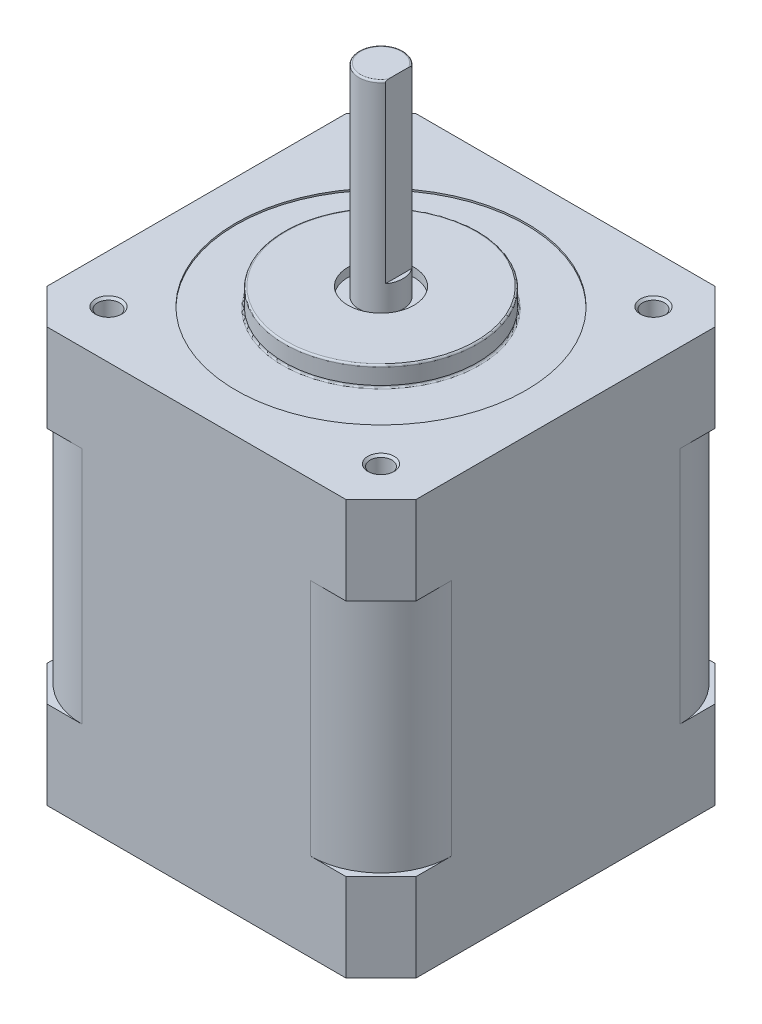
ISO-10303-21;
HEADER;
FILE_DESCRIPTION(('STEP AP214'),'2;1');
FILE_NAME('part.step','',(''),(''),'','','');
FILE_SCHEMA(('AUTOMOTIVE_DESIGN { 1 0 10303 214 1 1 1 1 }'));
ENDSEC;
DATA;
#1=APPLICATION_CONTEXT('core data for automotive mechanical design processes');
#2=APPLICATION_PROTOCOL_DEFINITION('international standard','automotive_design',2000,#1);
#3=PRODUCT_CONTEXT('',#1,'mechanical');
#4=PRODUCT('Part','Part','',(#3));
#5=PRODUCT_RELATED_PRODUCT_CATEGORY('part','',(#4));
#6=PRODUCT_DEFINITION_FORMATION('','',#4);
#7=PRODUCT_DEFINITION_CONTEXT('part definition',#1,'design');
#8=PRODUCT_DEFINITION('design','',#6,#7);
#9=PRODUCT_DEFINITION_SHAPE('','',#8);
#10=(LENGTH_UNIT() NAMED_UNIT(*) SI_UNIT(.MILLI.,.METRE.));
#11=(NAMED_UNIT(*) PLANE_ANGLE_UNIT() SI_UNIT($,.RADIAN.));
#12=(NAMED_UNIT(*) SI_UNIT($,.STERADIAN.) SOLID_ANGLE_UNIT());
#13=UNCERTAINTY_MEASURE_WITH_UNIT(LENGTH_MEASURE(1.E-05),#10,'distance_accuracy_value','');
#14=(GEOMETRIC_REPRESENTATION_CONTEXT(3) GLOBAL_UNCERTAINTY_ASSIGNED_CONTEXT((#13)) GLOBAL_UNIT_ASSIGNED_CONTEXT((#10,
#11,#12)) REPRESENTATION_CONTEXT('',''));
#15=CARTESIAN_POINT('',(0.,0.,0.));
#16=DIRECTION('',(0.,0.,1.));
#17=DIRECTION('',(1.,0.,0.));
#18=AXIS2_PLACEMENT_3D('',#15,#16,#17);
#19=CARTESIAN_POINT('',(-21.,1.5,-21.));
#20=DIRECTION('',(0.,-1.,0.));
#21=DIRECTION('',(0.,0.,-1.));
#22=AXIS2_PLACEMENT_3D('',#19,#20,#21);
#23=PLANE('',#22);
#24=CARTESIAN_POINT('',(-21.,1.5,-21.));
#25=DIRECTION('',(0.,1.,0.));
#26=DIRECTION('',(1.,0.,0.));
#27=AXIS2_PLACEMENT_3D('',#24,#25,#26);
#28=CIRCLE('',#27,3.75);
#29=CARTESIAN_POINT('',(-24.75,1.5,-21.));
#30=VERTEX_POINT('',#29);
#31=EDGE_CURVE('E10',#30,#30,#28,.T.);
#32=ORIENTED_EDGE('',*,*,#31,.F.);
#33=EDGE_LOOP('',(#32));
#34=FACE_BOUND('',#33,.T.);
#35=ADVANCED_FACE('F16',(#34),#23,.T.);
#36=CARTESIAN_POINT('',(-21.,0.,-21.));
#37=DIRECTION('',(0.,1.,0.));
#38=DIRECTION('',(1.,0.,0.));
#39=AXIS2_PLACEMENT_3D('',#36,#37,#38);
#40=CYLINDRICAL_SURFACE('',#39,3.75);
#41=CARTESIAN_POINT('',(-21.,0.,-21.));
#42=DIRECTION('',(0.,1.,0.));
#43=DIRECTION('',(1.,0.,0.));
#44=AXIS2_PLACEMENT_3D('',#41,#42,#43);
#45=CIRCLE('',#44,3.75);
#46=CARTESIAN_POINT('',(-24.75,0.,-21.));
#47=VERTEX_POINT('',#46);
#48=EDGE_CURVE('E1219',#47,#47,#45,.T.);
#49=ORIENTED_EDGE('',*,*,#48,.F.);
#50=DIRECTION('',(0.,1.,0.));
#51=VECTOR('',#50,1.);
#52=CARTESIAN_POINT('',(-24.75,0.,-21.));
#53=LINE('',#52,#51);
#54=EDGE_CURVE('E26',#47,#30,#53,.T.);
#55=ORIENTED_EDGE('',*,*,#54,.T.);
#56=ORIENTED_EDGE('',*,*,#31,.T.);
#57=ORIENTED_EDGE('',*,*,#54,.F.);
#58=EDGE_LOOP('',(#49,#55,#56,#57));
#59=FACE_BOUND('',#58,.T.);
#60=ADVANCED_FACE('F836',(#59),#40,.F.);
#61=CARTESIAN_POINT('',(-5.5,2.25,-36.5));
#62=DIRECTION('',(0.,-1.,0.));
#63=DIRECTION('',(1.,0.,0.));
#64=AXIS2_PLACEMENT_3D('',#61,#62,#63);
#65=CYLINDRICAL_SURFACE('',#64,1.25);
#66=CARTESIAN_POINT('',(-5.5,0.25,-36.5));
#67=DIRECTION('',(0.,-1.,0.));
#68=DIRECTION('',(1.,0.,0.));
#69=AXIS2_PLACEMENT_3D('',#66,#67,#68);
#70=CIRCLE('',#69,1.25);
#71=CARTESIAN_POINT('',(-6.75,0.25,-36.5));
#72=VERTEX_POINT('',#71);
#73=EDGE_CURVE('E765',#72,#72,#70,.T.);
#74=ORIENTED_EDGE('',*,*,#73,.T.);
#75=DIRECTION('',(0.,1.,0.));
#76=VECTOR('',#75,1.);
#77=CARTESIAN_POINT('',(-6.75,2.25,-36.5));
#78=LINE('',#77,#76);
#79=CARTESIAN_POINT('',(-6.75,4.5,-36.5));
#80=VERTEX_POINT('',#79);
#81=EDGE_CURVE('E49',#72,#80,#78,.T.);
#82=ORIENTED_EDGE('',*,*,#81,.T.);
#83=CARTESIAN_POINT('',(-5.5,4.5,-36.5));
#84=DIRECTION('',(0.,-1.,0.));
#85=DIRECTION('',(1.,0.,0.));
#86=AXIS2_PLACEMENT_3D('',#83,#84,#85);
#87=CIRCLE('',#86,1.25);
#88=EDGE_CURVE('E754',#80,#80,#87,.T.);
#89=ORIENTED_EDGE('',*,*,#88,.F.);
#90=ORIENTED_EDGE('',*,*,#81,.F.);
#91=EDGE_LOOP('',(#74,#82,#89,#90));
#92=FACE_BOUND('',#91,.T.);
#93=ADVANCED_FACE('F1955',(#92),#65,.F.);
#94=CARTESIAN_POINT('',(-5.5,0.125,-36.5));
#95=DIRECTION('',(0.,-1.,0.));
#96=DIRECTION('',(1.,0.,0.));
#97=AXIS2_PLACEMENT_3D('',#94,#95,#96);
#98=CONICAL_SURFACE('',#97,1.375,0.785398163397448);
#99=CARTESIAN_POINT('',(-5.5,0.,-36.5));
#100=DIRECTION('',(0.,1.,0.));
#101=DIRECTION('',(1.,0.,0.));
#102=AXIS2_PLACEMENT_3D('',#99,#100,#101);
#103=CIRCLE('',#102,1.5);
#104=CARTESIAN_POINT('',(-7.,0.,-36.5));
#105=VERTEX_POINT('',#104);
#106=EDGE_CURVE('E995',#105,#105,#103,.T.);
#107=ORIENTED_EDGE('',*,*,#106,.F.);
#108=DIRECTION('',(0.707106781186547,0.707106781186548,0.));
#109=VECTOR('',#108,1.);
#110=CARTESIAN_POINT('',(-6.875,0.125,-36.5));
#111=LINE('',#110,#109);
#112=EDGE_CURVE('E761',#105,#72,#111,.T.);
#113=ORIENTED_EDGE('',*,*,#112,.T.);
#114=ORIENTED_EDGE('',*,*,#73,.F.);
#115=ORIENTED_EDGE('',*,*,#112,.F.);
#116=EDGE_LOOP('',(#107,#113,#114,#115));
#117=FACE_BOUND('',#116,.T.);
#118=ADVANCED_FACE('F1996',(#117),#98,.F.);
#119=CARTESIAN_POINT('',(-5.5,4.87553788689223,-36.5));
#120=DIRECTION('',(0.,-1.,0.));
#121=DIRECTION('',(1.,0.,0.));
#122=AXIS2_PLACEMENT_3D('',#119,#120,#121);
#123=CONICAL_SURFACE('',#122,0.625,1.02974425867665);
#124=ORIENTED_EDGE('',*,*,#88,.T.);
#125=DIRECTION('',(0.857167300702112,0.515038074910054,0.));
#126=VECTOR('',#125,1.);
#127=CARTESIAN_POINT('',(-6.125,4.87553788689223,-36.5));
#128=LINE('',#127,#126);
#129=CARTESIAN_POINT('',(-5.5,5.25107577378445,-36.5));
#130=VERTEX_POINT('',#129);
#131=EDGE_CURVE('E758',#80,#130,#128,.T.);
#132=ORIENTED_EDGE('',*,*,#131,.T.);
#133=ORIENTED_EDGE('',*,*,#131,.F.);
#134=EDGE_LOOP('',(#124,#132,#133));
#135=FACE_BOUND('',#134,.T.);
#136=ADVANCED_FACE('F18',(#135),#123,.F.);
#137=CARTESIAN_POINT('',(-5.5,2.25,-5.5));
#138=DIRECTION('',(0.,-1.,0.));
#139=DIRECTION('',(1.,0.,0.));
#140=AXIS2_PLACEMENT_3D('',#137,#138,#139);
#141=CYLINDRICAL_SURFACE('',#140,1.25);
#142=CARTESIAN_POINT('',(-5.5,0.25,-5.5));
#143=DIRECTION('',(0.,-1.,0.));
#144=DIRECTION('',(1.,0.,0.));
#145=AXIS2_PLACEMENT_3D('',#142,#143,#144);
#146=CIRCLE('',#145,1.25);
#147=CARTESIAN_POINT('',(-6.75,0.25,-5.5));
#148=VERTEX_POINT('',#147);
#149=EDGE_CURVE('E751',#148,#148,#146,.T.);
#150=ORIENTED_EDGE('',*,*,#149,.T.);
#151=DIRECTION('',(0.,1.,0.));
#152=VECTOR('',#151,1.);
#153=CARTESIAN_POINT('',(-6.75,2.25,-5.5));
#154=LINE('',#153,#152);
#155=CARTESIAN_POINT('',(-6.75,4.5,-5.5));
#156=VERTEX_POINT('',#155);
#157=EDGE_CURVE('E170',#148,#156,#154,.T.);
#158=ORIENTED_EDGE('',*,*,#157,.T.);
#159=CARTESIAN_POINT('',(-5.5,4.5,-5.5));
#160=DIRECTION('',(0.,-1.,0.));
#161=DIRECTION('',(1.,0.,0.));
#162=AXIS2_PLACEMENT_3D('',#159,#160,#161);
#163=CIRCLE('',#162,1.25);
#164=EDGE_CURVE('E742',#156,#156,#163,.T.);
#165=ORIENTED_EDGE('',*,*,#164,.F.);
#166=ORIENTED_EDGE('',*,*,#157,.F.);
#167=EDGE_LOOP('',(#150,#158,#165,#166));
#168=FACE_BOUND('',#167,.T.);
#169=ADVANCED_FACE('F1980',(#168),#141,.F.);
#170=CARTESIAN_POINT('',(-5.5,0.125,-5.5));
#171=DIRECTION('',(0.,-1.,0.));
#172=DIRECTION('',(1.,0.,0.));
#173=AXIS2_PLACEMENT_3D('',#170,#171,#172);
#174=CONICAL_SURFACE('',#173,1.375,0.785398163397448);
#175=CARTESIAN_POINT('',(-5.5,0.,-5.5));
#176=DIRECTION('',(0.,1.,0.));
#177=DIRECTION('',(1.,0.,0.));
#178=AXIS2_PLACEMENT_3D('',#175,#176,#177);
#179=CIRCLE('',#178,1.5);
#180=CARTESIAN_POINT('',(-7.,0.,-5.5));
#181=VERTEX_POINT('',#180);
#182=EDGE_CURVE('E990',#181,#181,#179,.T.);
#183=ORIENTED_EDGE('',*,*,#182,.F.);
#184=DIRECTION('',(0.707106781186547,0.707106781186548,0.));
#185=VECTOR('',#184,1.);
#186=CARTESIAN_POINT('',(-6.875,0.125,-5.5));
#187=LINE('',#186,#185);
#188=EDGE_CURVE('E747',#181,#148,#187,.T.);
#189=ORIENTED_EDGE('',*,*,#188,.T.);
#190=ORIENTED_EDGE('',*,*,#149,.F.);
#191=ORIENTED_EDGE('',*,*,#188,.F.);
#192=EDGE_LOOP('',(#183,#189,#190,#191));
#193=FACE_BOUND('',#192,.T.);
#194=ADVANCED_FACE('F1973',(#193),#174,.F.);
#195=CARTESIAN_POINT('',(-5.5,4.87553788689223,-5.5));
#196=DIRECTION('',(0.,-1.,0.));
#197=DIRECTION('',(1.,0.,0.));
#198=AXIS2_PLACEMENT_3D('',#195,#196,#197);
#199=CONICAL_SURFACE('',#198,0.625,1.02974425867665);
#200=ORIENTED_EDGE('',*,*,#164,.T.);
#201=DIRECTION('',(0.857167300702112,0.515038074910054,0.));
#202=VECTOR('',#201,1.);
#203=CARTESIAN_POINT('',(-6.125,4.87553788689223,-5.5));
#204=LINE('',#203,#202);
#205=CARTESIAN_POINT('',(-5.5,5.25107577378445,-5.5));
#206=VERTEX_POINT('',#205);
#207=EDGE_CURVE('E746',#156,#206,#204,.T.);
#208=ORIENTED_EDGE('',*,*,#207,.T.);
#209=ORIENTED_EDGE('',*,*,#207,.F.);
#210=EDGE_LOOP('',(#200,#208,#209));
#211=FACE_BOUND('',#210,.T.);
#212=ADVANCED_FACE('F1971',(#211),#199,.F.);
#213=CARTESIAN_POINT('',(-36.5,2.25,-5.5));
#214=DIRECTION('',(0.,-1.,0.));
#215=DIRECTION('',(1.,0.,0.));
#216=AXIS2_PLACEMENT_3D('',#213,#214,#215);
#217=CYLINDRICAL_SURFACE('',#216,1.25);
#218=CARTESIAN_POINT('',(-36.5,0.25,-5.5));
#219=DIRECTION('',(0.,-1.,0.));
#220=DIRECTION('',(1.,0.,0.));
#221=AXIS2_PLACEMENT_3D('',#218,#219,#220);
#222=CIRCLE('',#221,1.25);
#223=CARTESIAN_POINT('',(-37.75,0.25,-5.5));
#224=VERTEX_POINT('',#223);
#225=EDGE_CURVE('E737',#224,#224,#222,.T.);
#226=ORIENTED_EDGE('',*,*,#225,.T.);
#227=DIRECTION('',(0.,1.,0.));
#228=VECTOR('',#227,1.);
#229=CARTESIAN_POINT('',(-37.75,2.25,-5.5));
#230=LINE('',#229,#228);
#231=CARTESIAN_POINT('',(-37.75,4.5,-5.5));
#232=VERTEX_POINT('',#231);
#233=EDGE_CURVE('E741',#224,#232,#230,.T.);
#234=ORIENTED_EDGE('',*,*,#233,.T.);
#235=CARTESIAN_POINT('',(-36.5,4.5,-5.5));
#236=DIRECTION('',(0.,-1.,0.));
#237=DIRECTION('',(1.,0.,0.));
#238=AXIS2_PLACEMENT_3D('',#235,#236,#237);
#239=CIRCLE('',#238,1.25);
#240=EDGE_CURVE('E726',#232,#232,#239,.T.);
#241=ORIENTED_EDGE('',*,*,#240,.F.);
#242=ORIENTED_EDGE('',*,*,#233,.F.);
#243=EDGE_LOOP('',(#226,#234,#241,#242));
#244=FACE_BOUND('',#243,.T.);
#245=ADVANCED_FACE('F834',(#244),#217,.F.);
#246=CARTESIAN_POINT('',(-36.5,0.125,-5.5));
#247=DIRECTION('',(0.,-1.,0.));
#248=DIRECTION('',(1.,0.,0.));
#249=AXIS2_PLACEMENT_3D('',#246,#247,#248);
#250=CONICAL_SURFACE('',#249,1.375,0.785398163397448);
#251=CARTESIAN_POINT('',(-36.5,0.,-5.5));
#252=DIRECTION('',(0.,1.,0.));
#253=DIRECTION('',(1.,0.,0.));
#254=AXIS2_PLACEMENT_3D('',#251,#252,#253);
#255=CIRCLE('',#254,1.5);
#256=CARTESIAN_POINT('',(-38.,0.,-5.5));
#257=VERTEX_POINT('',#256);
#258=EDGE_CURVE('E994',#257,#257,#255,.T.);
#259=ORIENTED_EDGE('',*,*,#258,.F.);
#260=DIRECTION('',(0.707106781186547,0.707106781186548,0.));
#261=VECTOR('',#260,1.);
#262=CARTESIAN_POINT('',(-37.875,0.125,-5.5));
#263=LINE('',#262,#261);
#264=EDGE_CURVE('E733',#257,#224,#263,.T.);
#265=ORIENTED_EDGE('',*,*,#264,.T.);
#266=ORIENTED_EDGE('',*,*,#225,.F.);
#267=ORIENTED_EDGE('',*,*,#264,.F.);
#268=EDGE_LOOP('',(#259,#265,#266,#267));
#269=FACE_BOUND('',#268,.T.);
#270=ADVANCED_FACE('F1967',(#269),#250,.F.);
#271=CARTESIAN_POINT('',(-36.5,4.87553788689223,-5.5));
#272=DIRECTION('',(0.,-1.,0.));
#273=DIRECTION('',(1.,0.,0.));
#274=AXIS2_PLACEMENT_3D('',#271,#272,#273);
#275=CONICAL_SURFACE('',#274,0.625,1.02974425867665);
#276=ORIENTED_EDGE('',*,*,#240,.T.);
#277=DIRECTION('',(0.857167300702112,0.515038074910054,0.));
#278=VECTOR('',#277,1.);
#279=CARTESIAN_POINT('',(-37.125,4.87553788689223,-5.5));
#280=LINE('',#279,#278);
#281=CARTESIAN_POINT('',(-36.5,5.25107577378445,-5.5));
#282=VERTEX_POINT('',#281);
#283=EDGE_CURVE('E730',#232,#282,#280,.T.);
#284=ORIENTED_EDGE('',*,*,#283,.T.);
#285=ORIENTED_EDGE('',*,*,#283,.F.);
#286=EDGE_LOOP('',(#276,#284,#285));
#287=FACE_BOUND('',#286,.T.);
#288=ADVANCED_FACE('F1963',(#287),#275,.F.);
#289=CARTESIAN_POINT('',(-36.5,2.25,-36.5));
#290=DIRECTION('',(0.,-1.,0.));
#291=DIRECTION('',(1.,0.,0.));
#292=AXIS2_PLACEMENT_3D('',#289,#290,#291);
#293=CYLINDRICAL_SURFACE('',#292,1.25);
#294=CARTESIAN_POINT('',(-36.5,0.25,-36.5));
#295=DIRECTION('',(0.,-1.,0.));
#296=DIRECTION('',(1.,0.,0.));
#297=AXIS2_PLACEMENT_3D('',#294,#295,#296);
#298=CIRCLE('',#297,1.25);
#299=CARTESIAN_POINT('',(-37.75,0.25,-36.5));
#300=VERTEX_POINT('',#299);
#301=EDGE_CURVE('E719',#300,#300,#298,.T.);
#302=ORIENTED_EDGE('',*,*,#301,.T.);
#303=DIRECTION('',(0.,1.,0.));
#304=VECTOR('',#303,1.);
#305=CARTESIAN_POINT('',(-37.75,2.25,-36.5));
#306=LINE('',#305,#304);
#307=CARTESIAN_POINT('',(-37.75,4.5,-36.5));
#308=VERTEX_POINT('',#307);
#309=EDGE_CURVE('E723',#300,#308,#306,.T.);
#310=ORIENTED_EDGE('',*,*,#309,.T.);
#311=CARTESIAN_POINT('',(-36.5,4.5,-36.5));
#312=DIRECTION('',(0.,-1.,0.));
#313=DIRECTION('',(1.,0.,0.));
#314=AXIS2_PLACEMENT_3D('',#311,#312,#313);
#315=CIRCLE('',#314,1.25);
#316=EDGE_CURVE('E708',#308,#308,#315,.T.);
#317=ORIENTED_EDGE('',*,*,#316,.F.);
#318=ORIENTED_EDGE('',*,*,#309,.F.);
#319=EDGE_LOOP('',(#302,#310,#317,#318));
#320=FACE_BOUND('',#319,.T.);
#321=ADVANCED_FACE('F1960',(#320),#293,.F.);
#322=CARTESIAN_POINT('',(-36.5,0.125,-36.5));
#323=DIRECTION('',(0.,-1.,0.));
#324=DIRECTION('',(1.,0.,0.));
#325=AXIS2_PLACEMENT_3D('',#322,#323,#324);
#326=CONICAL_SURFACE('',#325,1.375,0.785398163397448);
#327=CARTESIAN_POINT('',(-36.5,0.,-36.5));
#328=DIRECTION('',(0.,1.,0.));
#329=DIRECTION('',(1.,0.,0.));
#330=AXIS2_PLACEMENT_3D('',#327,#328,#329);
#331=CIRCLE('',#330,1.5);
#332=CARTESIAN_POINT('',(-38.,0.,-36.5));
#333=VERTEX_POINT('',#332);
#334=EDGE_CURVE('E1136',#333,#333,#331,.T.);
#335=ORIENTED_EDGE('',*,*,#334,.F.);
#336=DIRECTION('',(0.707106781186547,0.707106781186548,0.));
#337=VECTOR('',#336,1.);
#338=CARTESIAN_POINT('',(-37.875,0.125,-36.5));
#339=LINE('',#338,#337);
#340=EDGE_CURVE('E715',#333,#300,#339,.T.);
#341=ORIENTED_EDGE('',*,*,#340,.T.);
#342=ORIENTED_EDGE('',*,*,#301,.F.);
#343=ORIENTED_EDGE('',*,*,#340,.F.);
#344=EDGE_LOOP('',(#335,#341,#342,#343));
#345=FACE_BOUND('',#344,.T.);
#346=ADVANCED_FACE('F1958',(#345),#326,.F.);
#347=CARTESIAN_POINT('',(-36.5,4.87553788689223,-36.5));
#348=DIRECTION('',(0.,-1.,0.));
#349=DIRECTION('',(1.,0.,0.));
#350=AXIS2_PLACEMENT_3D('',#347,#348,#349);
#351=CONICAL_SURFACE('',#350,0.625,1.02974425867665);
#352=ORIENTED_EDGE('',*,*,#316,.T.);
#353=DIRECTION('',(0.857167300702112,0.515038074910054,0.));
#354=VECTOR('',#353,1.);
#355=CARTESIAN_POINT('',(-37.125,4.87553788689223,-36.5));
#356=LINE('',#355,#354);
#357=CARTESIAN_POINT('',(-36.5,5.25107577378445,-36.5));
#358=VERTEX_POINT('',#357);
#359=EDGE_CURVE('E712',#308,#358,#356,.T.);
#360=ORIENTED_EDGE('',*,*,#359,.T.);
#361=ORIENTED_EDGE('',*,*,#359,.F.);
#362=EDGE_LOOP('',(#352,#360,#361));
#363=FACE_BOUND('',#362,.T.);
#364=ADVANCED_FACE('F2180',(#363),#351,.F.);
#365=CARTESIAN_POINT('',(-42.,0.,0.));
#366=DIRECTION('',(0.,0.,1.));
#367=DIRECTION('',(1.,0.,0.));
#368=AXIS2_PLACEMENT_3D('',#365,#366,#367);
#369=PLANE('',#368);
#370=DIRECTION('',(0.,-1.,0.));
#371=VECTOR('',#370,1.);
#372=CARTESIAN_POINT('',(-38.,23.575,0.));
#373=LINE('',#372,#371);
#374=CARTESIAN_POINT('',(-38.,47.15,0.));
#375=VERTEX_POINT('',#374);
#376=CARTESIAN_POINT('',(-38.,37.15,0.));
#377=VERTEX_POINT('',#376);
#378=EDGE_CURVE('E967',#375,#377,#373,.T.);
#379=ORIENTED_EDGE('',*,*,#378,.T.);
#380=DIRECTION('',(1.,0.,0.));
#381=VECTOR('',#380,1.);
#382=CARTESIAN_POINT('',(-42.,37.15,0.));
#383=LINE('',#382,#381);
#384=CARTESIAN_POINT('',(-34.,37.15,0.));
#385=VERTEX_POINT('',#384);
#386=EDGE_CURVE('E935',#377,#385,#383,.T.);
#387=ORIENTED_EDGE('',*,*,#386,.T.);
#388=DIRECTION('',(0.,1.,0.));
#389=VECTOR('',#388,1.);
#390=CARTESIAN_POINT('',(-34.,10.,0.));
#391=LINE('',#390,#389);
#392=CARTESIAN_POINT('',(-34.,10.,0.));
#393=VERTEX_POINT('',#392);
#394=EDGE_CURVE('E950',#393,#385,#391,.T.);
#395=ORIENTED_EDGE('',*,*,#394,.F.);
#396=DIRECTION('',(-1.,0.,0.));
#397=VECTOR('',#396,1.);
#398=CARTESIAN_POINT('',(-21.,10.,0.));
#399=LINE('',#398,#397);
#400=CARTESIAN_POINT('',(-38.,10.,0.));
#401=VERTEX_POINT('',#400);
#402=EDGE_CURVE('E701',#393,#401,#399,.T.);
#403=ORIENTED_EDGE('',*,*,#402,.T.);
#404=DIRECTION('',(0.,-1.,0.));
#405=VECTOR('',#404,1.);
#406=CARTESIAN_POINT('',(-38.,23.575,0.));
#407=LINE('',#406,#405);
#408=CARTESIAN_POINT('',(-38.,0.,0.));
#409=VERTEX_POINT('',#408);
#410=EDGE_CURVE('E1102',#401,#409,#407,.T.);
#411=ORIENTED_EDGE('',*,*,#410,.T.);
#412=DIRECTION('',(1.,0.,0.));
#413=VECTOR('',#412,1.);
#414=CARTESIAN_POINT('',(-42.,0.,0.));
#415=LINE('',#414,#413);
#416=CARTESIAN_POINT('',(-4.,0.,0.));
#417=VERTEX_POINT('',#416);
#418=EDGE_CURVE('E1147',#409,#417,#415,.T.);
#419=ORIENTED_EDGE('',*,*,#418,.T.);
#420=DIRECTION('',(0.,1.,0.));
#421=VECTOR('',#420,1.);
#422=CARTESIAN_POINT('',(-4.,23.575,0.));
#423=LINE('',#422,#421);
#424=CARTESIAN_POINT('',(-4.,10.,0.));
#425=VERTEX_POINT('',#424);
#426=EDGE_CURVE('E1128',#417,#425,#423,.T.);
#427=ORIENTED_EDGE('',*,*,#426,.T.);
#428=DIRECTION('',(-1.,0.,0.));
#429=VECTOR('',#428,1.);
#430=CARTESIAN_POINT('',(-21.,10.,0.));
#431=LINE('',#430,#429);
#432=CARTESIAN_POINT('',(-8.,10.,0.));
#433=VERTEX_POINT('',#432);
#434=EDGE_CURVE('E705',#425,#433,#431,.T.);
#435=ORIENTED_EDGE('',*,*,#434,.T.);
#436=DIRECTION('',(0.,1.,0.));
#437=VECTOR('',#436,1.);
#438=CARTESIAN_POINT('',(-8.,10.,0.));
#439=LINE('',#438,#437);
#440=CARTESIAN_POINT('',(-8.,37.15,0.));
#441=VERTEX_POINT('',#440);
#442=EDGE_CURVE('E973',#433,#441,#439,.T.);
#443=ORIENTED_EDGE('',*,*,#442,.T.);
#444=DIRECTION('',(1.,0.,0.));
#445=VECTOR('',#444,1.);
#446=CARTESIAN_POINT('',(-42.,37.15,0.));
#447=LINE('',#446,#445);
#448=CARTESIAN_POINT('',(-4.,37.15,0.));
#449=VERTEX_POINT('',#448);
#450=EDGE_CURVE('E1120',#441,#449,#447,.T.);
#451=ORIENTED_EDGE('',*,*,#450,.T.);
#452=DIRECTION('',(0.,1.,0.));
#453=VECTOR('',#452,1.);
#454=CARTESIAN_POINT('',(-4.,23.575,0.));
#455=LINE('',#454,#453);
#456=CARTESIAN_POINT('',(-4.,47.15,0.));
#457=VERTEX_POINT('',#456);
#458=EDGE_CURVE('E1004',#449,#457,#455,.T.);
#459=ORIENTED_EDGE('',*,*,#458,.T.);
#460=DIRECTION('',(1.,0.,0.));
#461=VECTOR('',#460,1.);
#462=CARTESIAN_POINT('',(-42.,47.15,0.));
#463=LINE('',#462,#461);
#464=EDGE_CURVE('E1174',#375,#457,#463,.T.);
#465=ORIENTED_EDGE('',*,*,#464,.F.);
#466=EDGE_LOOP('',(#379,#387,#395,#403,#411,#419,#427,#435,#443,#451,#459,#465));
#467=FACE_BOUND('',#466,.T.);
#468=ADVANCED_FACE('F1871',(#467),#369,.T.);
#469=CARTESIAN_POINT('',(0.,10.,0.));
#470=DIRECTION('',(0.,-1.,0.));
#471=DIRECTION('',(0.,0.,-1.));
#472=AXIS2_PLACEMENT_3D('',#469,#470,#471);
#473=PLANE('',#472);
#474=DIRECTION('',(-0.707106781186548,0.,-0.707106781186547));
#475=VECTOR('',#474,1.);
#476=CARTESIAN_POINT('',(9.5,10.,-28.5));
#477=LINE('',#476,#475);
#478=CARTESIAN_POINT('',(0.,10.,-38.));
#479=VERTEX_POINT('',#478);
#480=CARTESIAN_POINT('',(-4.,10.,-42.));
#481=VERTEX_POINT('',#480);
#482=EDGE_CURVE('E1066',#479,#481,#477,.T.);
#483=ORIENTED_EDGE('',*,*,#482,.T.);
#484=DIRECTION('',(1.,0.,0.));
#485=VECTOR('',#484,1.);
#486=CARTESIAN_POINT('',(0.,10.,-42.));
#487=LINE('',#486,#485);
#488=CARTESIAN_POINT('',(-8.,10.,-42.));
#489=VERTEX_POINT('',#488);
#490=EDGE_CURVE('E1112',#489,#481,#487,.T.);
#491=ORIENTED_EDGE('',*,*,#490,.F.);
#492=CARTESIAN_POINT('',(-8.,10.,-34.));
#493=DIRECTION('',(0.,-1.,0.));
#494=DIRECTION('',(1.,0.,0.));
#495=AXIS2_PLACEMENT_3D('',#492,#493,#494);
#496=CIRCLE('',#495,8.);
#497=CARTESIAN_POINT('',(0.,10.,-34.));
#498=VERTEX_POINT('',#497);
#499=EDGE_CURVE('E976',#489,#498,#496,.T.);
#500=ORIENTED_EDGE('',*,*,#499,.T.);
#501=DIRECTION('',(0.,0.,1.));
#502=VECTOR('',#501,1.);
#503=CARTESIAN_POINT('',(0.,10.,0.));
#504=LINE('',#503,#502);
#505=EDGE_CURVE('E1148',#479,#498,#504,.T.);
#506=ORIENTED_EDGE('',*,*,#505,.F.);
#507=EDGE_LOOP('',(#483,#491,#500,#506));
#508=FACE_BOUND('',#507,.T.);
#509=ADVANCED_FACE('F1833',(#508),#473,.F.);
#510=CARTESIAN_POINT('',(0.,10.,0.));
#511=DIRECTION('',(0.,-1.,0.));
#512=DIRECTION('',(0.,0.,-1.));
#513=AXIS2_PLACEMENT_3D('',#510,#511,#512);
#514=PLANE('',#513);
#515=DIRECTION('',(-0.707106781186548,0.,0.707106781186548));
#516=VECTOR('',#515,1.);
#517=CARTESIAN_POINT('',(-39.,10.,-41.));
#518=LINE('',#517,#516);
#519=CARTESIAN_POINT('',(-38.,10.,-42.));
#520=VERTEX_POINT('',#519);
#521=CARTESIAN_POINT('',(-42.,10.,-38.));
#522=VERTEX_POINT('',#521);
#523=EDGE_CURVE('E1054',#520,#522,#518,.T.);
#524=ORIENTED_EDGE('',*,*,#523,.T.);
#525=DIRECTION('',(0.,0.,-1.));
#526=VECTOR('',#525,1.);
#527=CARTESIAN_POINT('',(-42.,10.,-21.));
#528=LINE('',#527,#526);
#529=CARTESIAN_POINT('',(-42.,10.,-34.));
#530=VERTEX_POINT('',#529);
#531=EDGE_CURVE('E1040',#530,#522,#528,.T.);
#532=ORIENTED_EDGE('',*,*,#531,.F.);
#533=CARTESIAN_POINT('',(-34.,10.,-34.));
#534=DIRECTION('',(0.,-1.,0.));
#535=DIRECTION('',(0.,0.,-1.));
#536=AXIS2_PLACEMENT_3D('',#533,#534,#535);
#537=CIRCLE('',#536,8.);
#538=CARTESIAN_POINT('',(-34.,10.,-42.));
#539=VERTEX_POINT('',#538);
#540=EDGE_CURVE('E1135',#530,#539,#537,.T.);
#541=ORIENTED_EDGE('',*,*,#540,.T.);
#542=DIRECTION('',(1.,0.,0.));
#543=VECTOR('',#542,1.);
#544=CARTESIAN_POINT('',(0.,10.,-42.));
#545=LINE('',#544,#543);
#546=EDGE_CURVE('E920',#520,#539,#545,.T.);
#547=ORIENTED_EDGE('',*,*,#546,.F.);
#548=EDGE_LOOP('',(#524,#532,#541,#547));
#549=FACE_BOUND('',#548,.T.);
#550=ADVANCED_FACE('F1851',(#549),#514,.F.);
#551=CARTESIAN_POINT('',(0.,10.,0.));
#552=DIRECTION('',(0.,-1.,0.));
#553=DIRECTION('',(0.,0.,-1.));
#554=AXIS2_PLACEMENT_3D('',#551,#552,#553);
#555=PLANE('',#554);
#556=DIRECTION('',(0.707106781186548,0.,-0.707106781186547));
#557=VECTOR('',#556,1.);
#558=CARTESIAN_POINT('',(-3.,10.,-1.));
#559=LINE('',#558,#557);
#560=CARTESIAN_POINT('',(0.,10.,-4.));
#561=VERTEX_POINT('',#560);
#562=EDGE_CURVE('E1124',#425,#561,#559,.T.);
#563=ORIENTED_EDGE('',*,*,#562,.T.);
#564=DIRECTION('',(0.,0.,1.));
#565=VECTOR('',#564,1.);
#566=CARTESIAN_POINT('',(0.,10.,0.));
#567=LINE('',#566,#565);
#568=CARTESIAN_POINT('',(0.,10.,-8.));
#569=VERTEX_POINT('',#568);
#570=EDGE_CURVE('E1044',#569,#561,#567,.T.);
#571=ORIENTED_EDGE('',*,*,#570,.F.);
#572=CARTESIAN_POINT('',(-8.,10.,-8.));
#573=DIRECTION('',(0.,-1.,0.));
#574=DIRECTION('',(0.,0.,1.));
#575=AXIS2_PLACEMENT_3D('',#572,#573,#574);
#576=CIRCLE('',#575,8.);
#577=EDGE_CURVE('E951',#569,#433,#576,.T.);
#578=ORIENTED_EDGE('',*,*,#577,.T.);
#579=ORIENTED_EDGE('',*,*,#434,.F.);
#580=EDGE_LOOP('',(#563,#571,#578,#579));
#581=FACE_BOUND('',#580,.T.);
#582=ADVANCED_FACE('F2027',(#581),#555,.F.);
#583=CARTESIAN_POINT('',(0.,10.,0.));
#584=DIRECTION('',(0.,-1.,0.));
#585=DIRECTION('',(0.,0.,-1.));
#586=AXIS2_PLACEMENT_3D('',#583,#584,#585);
#587=PLANE('',#586);
#588=DIRECTION('',(0.707106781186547,0.,0.707106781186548));
#589=VECTOR('',#588,1.);
#590=CARTESIAN_POINT('',(-30.5,10.,7.5));
#591=LINE('',#590,#589);
#592=CARTESIAN_POINT('',(-42.,10.,-4.));
#593=VERTEX_POINT('',#592);
#594=EDGE_CURVE('E968',#593,#401,#591,.T.);
#595=ORIENTED_EDGE('',*,*,#594,.T.);
#596=ORIENTED_EDGE('',*,*,#402,.F.);
#597=CARTESIAN_POINT('',(-34.,10.,-8.));
#598=DIRECTION('',(0.,-1.,0.));
#599=DIRECTION('',(-1.,0.,0.));
#600=AXIS2_PLACEMENT_3D('',#597,#598,#599);
#601=CIRCLE('',#600,8.);
#602=CARTESIAN_POINT('',(-42.,10.,-8.));
#603=VERTEX_POINT('',#602);
#604=EDGE_CURVE('E947',#393,#603,#601,.T.);
#605=ORIENTED_EDGE('',*,*,#604,.T.);
#606=DIRECTION('',(0.,0.,-1.));
#607=VECTOR('',#606,1.);
#608=CARTESIAN_POINT('',(-42.,10.,-21.));
#609=LINE('',#608,#607);
#610=EDGE_CURVE('E1078',#593,#603,#609,.T.);
#611=ORIENTED_EDGE('',*,*,#610,.F.);
#612=EDGE_LOOP('',(#595,#596,#605,#611));
#613=FACE_BOUND('',#612,.T.);
#614=ADVANCED_FACE('F833',(#613),#587,.F.);
#615=CARTESIAN_POINT('',(-19.,71.15,-19.5));
#616=DIRECTION('',(-1.,0.,0.));
#617=DIRECTION('',(0.,0.,1.));
#618=AXIS2_PLACEMENT_3D('',#615,#616,#617);
#619=PLANE('',#618);
#620=CARTESIAN_POINT('',(-19.,70.95,-19.5));
#621=CARTESIAN_POINT('',(-19.0000000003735,70.9519268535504,-19.4999998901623));
#622=CARTESIAN_POINT('',(-18.9999993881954,70.9538536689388,-19.5000472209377));
#623=CARTESIAN_POINT('',(-18.9999970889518,70.9577078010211,-19.5002360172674));
#624=CARTESIAN_POINT('',(-18.9999953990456,70.9596351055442,-19.5003777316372));
#625=CARTESIAN_POINT('',(-18.9999910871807,70.9634885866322,-19.5007553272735));
#626=CARTESIAN_POINT('',(-18.9999884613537,70.9654147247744,-19.5009915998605));
#627=CARTESIAN_POINT('',(-18.9999824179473,70.9692642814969,-19.501558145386));
#628=CARTESIAN_POINT('',(-18.9999789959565,70.9711876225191,-19.5018889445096));
#629=CARTESIAN_POINT('',(-18.9999714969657,70.9750299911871,-19.5026443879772));
#630=CARTESIAN_POINT('',(-18.9999674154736,70.9769488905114,-19.5030696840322));
#631=CARTESIAN_POINT('',(-18.9999587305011,70.9807807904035,-19.5040139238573));
#632=CARTESIAN_POINT('',(-18.9999541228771,70.9826936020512,-19.50453363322));
#633=CARTESIAN_POINT('',(-18.9999445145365,70.9865117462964,-19.505666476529));
#634=CARTESIAN_POINT('',(-18.9999395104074,70.9884168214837,-19.5062804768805));
#635=CARTESIAN_POINT('',(-18.9999292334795,70.9922179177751,-19.5076016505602));
#636=CARTESIAN_POINT('',(-18.999923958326,70.9941136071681,-19.5083097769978));
#637=CARTESIAN_POINT('',(-18.9999132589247,70.9978943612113,-19.5098189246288));
#638=CARTESIAN_POINT('',(-18.999907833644,70.9997790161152,-19.5106209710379));
#639=CARTESIAN_POINT('',(-18.9998969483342,71.0035361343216,-19.5123176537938));
#640=CARTESIAN_POINT('',(-18.999891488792,71.0054081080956,-19.5132133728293));
#641=CARTESIAN_POINT('',(-18.9998806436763,71.009138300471,-19.5150970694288));
#642=CARTESIAN_POINT('',(-18.9998752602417,71.0109959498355,-19.516086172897));
#643=CARTESIAN_POINT('',(-18.9998646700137,71.0146959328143,-19.5181562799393));
#644=CARTESIAN_POINT('',(-18.9998594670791,71.0165376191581,-19.519238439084));
#645=CARTESIAN_POINT('',(-18.9998493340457,71.0202041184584,-19.5214942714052));
#646=CARTESIAN_POINT('',(-18.9998444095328,71.0220282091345,-19.5226691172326));
#647=CARTESIAN_POINT('',(-18.9998349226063,71.02565796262,-19.5251099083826));
#648=CARTESIAN_POINT('',(-18.9998303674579,71.0274628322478,-19.5263770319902));
#649=CARTESIAN_POINT('',(-18.9998217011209,71.0310525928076,-19.5290019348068));
#650=CARTESIAN_POINT('',(-18.9998175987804,71.03283662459,-19.5303608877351));
#651=CARTESIAN_POINT('',(-18.999809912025,71.0363831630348,-19.533168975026));
#652=CARTESIAN_POINT('',(-18.9998063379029,71.0381447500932,-19.5346192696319));
#653=CARTESIAN_POINT('',(-18.999799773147,71.0416448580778,-19.5376095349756));
#654=CARTESIAN_POINT('',(-18.9997967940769,71.04338240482,-19.5391506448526));
#655=CARTESIAN_POINT('',(-18.9997914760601,71.0468328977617,-19.5423220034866));
#656=CARTESIAN_POINT('',(-18.9997891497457,71.0485448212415,-19.5439533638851));
#657=CARTESIAN_POINT('',(-18.9997851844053,71.0519425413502,-19.5473046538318));
#658=CARTESIAN_POINT('',(-18.9997835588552,71.0536272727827,-19.5490256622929));
#659=CARTESIAN_POINT('',(-18.999781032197,71.0569690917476,-19.552555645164));
#660=CARTESIAN_POINT('',(-18.9997801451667,71.0586250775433,-19.5543656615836));
#661=CARTESIAN_POINT('',(-18.9997791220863,71.0619079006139,-19.5580730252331));
#662=CARTESIAN_POINT('',(-18.9997790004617,71.063533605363,-19.5599713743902));
#663=CARTESIAN_POINT('',(-18.9997795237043,71.0667543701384,-19.5638547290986));
#664=CARTESIAN_POINT('',(-18.9997801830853,71.0683482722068,-19.5658406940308));
#665=CARTESIAN_POINT('',(-18.9997822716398,71.0715039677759,-19.5698985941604));
#666=CARTESIAN_POINT('',(-18.9997837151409,71.0730645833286,-19.5719714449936));
#667=CARTESIAN_POINT('',(-18.9997873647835,71.0761521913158,-19.5762023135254));
#668=CARTESIAN_POINT('',(-18.999789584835,71.0776779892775,-19.5783612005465));
#669=CARTESIAN_POINT('',(-18.9997974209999,71.0822455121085,-19.5850267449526));
#670=CARTESIAN_POINT('',(-18.999804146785,71.0851853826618,-19.5896036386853));
#671=CARTESIAN_POINT('',(-18.99982025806,71.0909182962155,-19.5990850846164));
#672=CARTESIAN_POINT('',(-18.9998297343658,71.0937016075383,-19.6039954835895));
#673=CARTESIAN_POINT('',(-18.9998504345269,71.0991106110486,-19.614137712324));
#674=CARTESIAN_POINT('',(-18.9998617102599,71.1017265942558,-19.6193747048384));
#675=CARTESIAN_POINT('',(-18.9998865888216,71.1067911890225,-19.6301627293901));
#676=CARTESIAN_POINT('',(-18.9999002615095,71.1092302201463,-19.6357182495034));
#677=CARTESIAN_POINT('',(-18.9999188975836,71.1130116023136,-19.644909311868));
#678=CARTESIAN_POINT('',(-18.9999252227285,71.1144317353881,-19.6485131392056));
#679=CARTESIAN_POINT('',(-18.999934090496,71.1172095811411,-19.6558682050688));
#680=CARTESIAN_POINT('',(-18.9999365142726,71.1185641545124,-19.6596206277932));
#681=CARTESIAN_POINT('',(-18.9999408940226,71.1225861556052,-19.6712610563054));
#682=CARTESIAN_POINT('',(-18.9999394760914,71.1250796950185,-19.6792096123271));
#683=CARTESIAN_POINT('',(-18.9999345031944,71.1297839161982,-19.6956708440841));
#684=CARTESIAN_POINT('',(-18.9999308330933,71.1319709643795,-19.7041901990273));
#685=CARTESIAN_POINT('',(-18.9999257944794,71.1360313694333,-19.7217781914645));
#686=CARTESIAN_POINT('',(-18.99992455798,71.1378820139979,-19.730852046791));
#687=CARTESIAN_POINT('',(-18.9999265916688,71.1412392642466,-19.7495311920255));
#688=CARTESIAN_POINT('',(-18.9999300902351,71.1427240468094,-19.7591403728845));
#689=CARTESIAN_POINT('',(-18.9999415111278,71.145320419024,-19.7788706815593));
#690=CARTESIAN_POINT('',(-18.9999496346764,71.1464110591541,-19.7889945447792));
#691=CARTESIAN_POINT('',(-18.9999677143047,71.1481918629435,-19.8097326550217));
#692=CARTESIAN_POINT('',(-18.9999777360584,71.1488619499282,-19.8203485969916));
#693=CARTESIAN_POINT('',(-18.9999938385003,71.1497752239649,-19.8420491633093));
#694=CARTESIAN_POINT('',(-18.9999997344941,71.1499991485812,-19.8531346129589));
#695=CARTESIAN_POINT('',(-19.,71.15,-19.8642183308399));
#696=B_SPLINE_CURVE_WITH_KNOTS('',3,(#620,#621,#622,#623,#624,#625,#626,#627,#628,#629,#630,
#631,#632,#633,#634,#635,#636,#637,#638,#639,#640,#641,#642,#643,#644,#645,#646,#647,#648,#649,
#650,#651,#652,#653,#654,#655,#656,#657,#658,#659,#660,#661,#662,#663,#664,#665,#666,#667,#668,
#669,#670,#671,#672,#673,#674,#675,#676,#677,#678,#679,#680,#681,#682,#683,#684,#685,#686,#687,
#688,#689,#690,#691,#692,#693,#694,#695),.UNSPECIFIED.,.F.,.F.,(4,2,2,2,2,2,2,2,2,2,2,2,2,2,2,2,
2,2,2,2,2,2,2,2,2,2,2,2,2,2,2,2,2,2,2,2,2,4),(0.,0.00577992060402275,0.0115751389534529,
0.0173945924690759,0.0232470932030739,0.0291412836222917,0.035085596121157,0.0410882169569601,
0.0471570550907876,0.0532997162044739,0.059523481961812,0.0658352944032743,0.0722417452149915,
0.078749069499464,0.0853631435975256,0.0920894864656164,0.0989332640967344,0.105899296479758,
0.112992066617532,0.12021573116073,0.127574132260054,0.135070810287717,0.142709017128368,
0.150491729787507,0.158421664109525,0.174731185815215,0.191656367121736,0.209210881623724,
0.227405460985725,0.239024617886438,0.250991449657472,0.275969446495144,0.302345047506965,
0.33011581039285,0.359274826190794,0.389811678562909,0.421713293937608,0.454964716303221),.UNSPECIFIED.);
#697=CARTESIAN_POINT('',(-19.,70.95,-19.5));
#698=VERTEX_POINT('',#697);
#699=CARTESIAN_POINT('',(-19.,71.15,-19.8642183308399));
#700=VERTEX_POINT('',#699);
#701=EDGE_CURVE('E697',#698,#700,#696,.T.);
#702=ORIENTED_EDGE('',*,*,#701,.F.);
#703=DIRECTION('',(0.,1.,0.));
#704=VECTOR('',#703,1.);
#705=CARTESIAN_POINT('',(-19.,47.15,-19.5));
#706=LINE('',#705,#704);
#707=CARTESIAN_POINT('',(-19.,51.15,-19.5));
#708=VERTEX_POINT('',#707);
#709=EDGE_CURVE('E674',#708,#698,#706,.T.);
#710=ORIENTED_EDGE('',*,*,#709,.F.);
#711=DIRECTION('',(0.,0.,-1.));
#712=VECTOR('',#711,1.);
#713=CARTESIAN_POINT('',(-19.,51.15,-22.5));
#714=LINE('',#713,#712);
#715=CARTESIAN_POINT('',(-19.,51.15,-22.5));
#716=VERTEX_POINT('',#715);
#717=EDGE_CURVE('E698',#708,#716,#714,.T.);
#718=ORIENTED_EDGE('',*,*,#717,.T.);
#719=DIRECTION('',(0.,-1.,0.));
#720=VECTOR('',#719,1.);
#721=CARTESIAN_POINT('',(-19.,47.15,-22.5));
#722=LINE('',#721,#720);
#723=CARTESIAN_POINT('',(-19.,70.95,-22.5));
#724=VERTEX_POINT('',#723);
#725=EDGE_CURVE('E680',#724,#716,#722,.T.);
#726=ORIENTED_EDGE('',*,*,#725,.F.);
#727=CARTESIAN_POINT('',(-19.,71.15,-22.1357816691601));
#728=CARTESIAN_POINT('',(-18.999999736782,71.1499991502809,-22.146863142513));
#729=CARTESIAN_POINT('',(-18.9999937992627,71.1497753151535,-22.1579463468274));
#730=CARTESIAN_POINT('',(-18.9999775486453,71.1488623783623,-22.179643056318));
#731=CARTESIAN_POINT('',(-18.9999674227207,71.1481925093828,-22.1902573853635));
#732=CARTESIAN_POINT('',(-18.9999490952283,71.1464122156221,-22.2109929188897));
#733=CARTESIAN_POINT('',(-18.9999408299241,71.1453218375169,-22.221115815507));
#734=CARTESIAN_POINT('',(-18.9999291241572,71.1427259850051,-22.2408448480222));
#735=CARTESIAN_POINT('',(-18.9999254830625,71.141241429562,-22.2504537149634));
#736=CARTESIAN_POINT('',(-18.9999232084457,71.1378845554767,-22.2691328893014));
#737=CARTESIAN_POINT('',(-18.999924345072,71.1360340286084,-22.2782070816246));
#738=CARTESIAN_POINT('',(-18.9999292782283,71.1319737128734,-22.2957963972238));
#739=CARTESIAN_POINT('',(-18.9999329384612,71.1297866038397,-22.3043167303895));
#740=CARTESIAN_POINT('',(-18.999938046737,71.1250820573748,-22.3207805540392));
#741=CARTESIAN_POINT('',(-18.9999396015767,71.1225882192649,-22.3287307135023));
#742=CARTESIAN_POINT('',(-18.9999355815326,71.1185656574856,-22.3403737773));
#743=CARTESIAN_POINT('',(-18.9999332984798,71.1172108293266,-22.3441272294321));
#744=CARTESIAN_POINT('',(-18.9999247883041,71.1144324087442,-22.351484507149));
#745=CARTESIAN_POINT('',(-18.9999186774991,71.1130119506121,-22.3550895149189));
#746=CARTESIAN_POINT('',(-18.9999006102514,71.1092305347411,-22.3642814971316));
#747=CARTESIAN_POINT('',(-18.9998873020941,71.1067918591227,-22.3698367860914));
#748=CARTESIAN_POINT('',(-18.9998630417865,71.1017279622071,-22.3806243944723));
#749=CARTESIAN_POINT('',(-18.9998520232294,71.0991123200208,-22.3858612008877));
#750=CARTESIAN_POINT('',(-18.9998317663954,71.0937039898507,-22.396003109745));
#751=CARTESIAN_POINT('',(-18.999822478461,71.0909210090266,-22.4009133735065));
#752=CARTESIAN_POINT('',(-18.9998066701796,71.085188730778,-22.4103945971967));
#753=CARTESIAN_POINT('',(-18.999800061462,71.0822491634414,-22.4149714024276));
#754=CARTESIAN_POINT('',(-18.9997923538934,71.0776820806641,-22.4216368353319));
#755=CARTESIAN_POINT('',(-18.9997901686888,71.0761564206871,-22.423795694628));
#756=CARTESIAN_POINT('',(-18.9997865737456,71.0730690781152,-22.428026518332));
#757=CARTESIAN_POINT('',(-18.999785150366,71.0715085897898,-22.4300993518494));
#758=CARTESIAN_POINT('',(-18.9997830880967,71.0683531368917,-22.4341572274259));
#759=CARTESIAN_POINT('',(-18.9997824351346,71.0667593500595,-22.436143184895));
#760=CARTESIAN_POINT('',(-18.9997819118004,71.0635388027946,-22.4400265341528));
#761=CARTESIAN_POINT('',(-18.9997820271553,71.0619132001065,-22.441924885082));
#762=CARTESIAN_POINT('',(-18.999783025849,71.0586305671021,-22.4456322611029));
#763=CARTESIAN_POINT('',(-18.9997838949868,71.0569746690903,-22.4474422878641));
#764=CARTESIAN_POINT('',(-18.9997863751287,71.0536330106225,-22.4509722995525));
#765=CARTESIAN_POINT('',(-18.9997879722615,71.0519483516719,-22.4526933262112));
#766=CARTESIAN_POINT('',(-18.999791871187,71.0485507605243,-22.4560446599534));
#767=CARTESIAN_POINT('',(-18.999794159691,71.0468388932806,-22.4576760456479));
#768=CARTESIAN_POINT('',(-18.9997993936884,71.0433884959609,-22.4608474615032));
#769=CARTESIAN_POINT('',(-18.9998023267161,71.0416509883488,-22.4623886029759));
#770=CARTESIAN_POINT('',(-18.9998087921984,71.0381509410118,-22.465378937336));
#771=CARTESIAN_POINT('',(-18.9998123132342,71.0363893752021,-22.4668292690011));
#772=CARTESIAN_POINT('',(-18.9998198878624,71.0328428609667,-22.4696374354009));
#773=CARTESIAN_POINT('',(-18.9998239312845,71.031058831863,-22.4709964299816));
#774=CARTESIAN_POINT('',(-18.9998324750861,71.0274690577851,-22.4736214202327));
#775=CARTESIAN_POINT('',(-18.9998369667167,71.0256641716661,-22.474888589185));
#776=CARTESIAN_POINT('',(-18.9998463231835,71.0220343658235,-22.4773294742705));
#777=CARTESIAN_POINT('',(-18.9998511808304,71.0202102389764,-22.4785043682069));
#778=CARTESIAN_POINT('',(-18.9998611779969,71.0165436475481,-22.48076029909));
#779=CARTESIAN_POINT('',(-18.9998663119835,71.0147019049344,-22.4818425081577));
#780=CARTESIAN_POINT('',(-18.9998767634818,71.0110017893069,-22.4839127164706));
#781=CARTESIAN_POINT('',(-18.999882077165,71.0091440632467,-22.4849018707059));
#782=CARTESIAN_POINT('',(-18.9998927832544,71.0054136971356,-22.4867856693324));
#783=CARTESIAN_POINT('',(-18.9998981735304,71.0035416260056,-22.4876814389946));
#784=CARTESIAN_POINT('',(-18.9999089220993,70.9997842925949,-22.4893782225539));
#785=CARTESIAN_POINT('',(-18.9999142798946,70.9978995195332,-22.4901803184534));
#786=CARTESIAN_POINT('',(-18.9999248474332,70.9941185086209,-22.4916895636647));
#787=CARTESIAN_POINT('',(-18.9999300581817,70.9922226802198,-22.4923977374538));
#788=CARTESIAN_POINT('',(-18.9999402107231,70.9884212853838,-22.4937190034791));
#789=CARTESIAN_POINT('',(-18.9999451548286,70.9865160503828,-22.4943330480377));
#790=CARTESIAN_POINT('',(-18.9999546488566,70.9826975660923,-22.495465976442));
#791=CARTESIAN_POINT('',(-18.9999592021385,70.9807845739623,-22.4959857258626));
#792=CARTESIAN_POINT('',(-18.9999677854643,70.9769522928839,-22.4969300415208));
#793=CARTESIAN_POINT('',(-18.9999718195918,70.9750331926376,-22.4973553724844));
#794=CARTESIAN_POINT('',(-18.9999792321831,70.9711904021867,-22.4981108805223));
#795=CARTESIAN_POINT('',(-18.9999826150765,70.9692668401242,-22.4984417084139));
#796=CARTESIAN_POINT('',(-18.999988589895,70.9654168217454,-22.4990083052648));
#797=CARTESIAN_POINT('',(-18.9999911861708,70.9634904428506,-22.4992445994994));
#798=CARTESIAN_POINT('',(-18.9999954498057,70.9596364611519,-22.4996222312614));
#799=CARTESIAN_POINT('',(-18.999997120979,70.9577088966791,-22.4997639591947));
#800=CARTESIAN_POINT('',(-18.999999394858,70.9538542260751,-22.499952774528));
#801=CARTESIAN_POINT('',(-19.0000000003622,70.9519271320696,-22.5000001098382));
#802=CARTESIAN_POINT('',(-19.,70.95,-22.5));
#803=B_SPLINE_CURVE_WITH_KNOTS('',3,(#727,#728,#729,#730,#731,#732,#733,#734,#735,#736,#737,
#738,#739,#740,#741,#742,#743,#744,#745,#746,#747,#748,#749,#750,#751,#752,#753,#754,#755,#756,
#757,#758,#759,#760,#761,#762,#763,#764,#765,#766,#767,#768,#769,#770,#771,#772,#773,#774,#775,
#776,#777,#778,#779,#780,#781,#782,#783,#784,#785,#786,#787,#788,#789,#790,#791,#792,#793,#794,
#795,#796,#797,#798,#799,#800,#801,#802),.UNSPECIFIED.,.F.,.F.,(4,2,2,2,2,2,2,2,2,2,2,2,2,2,2,2,
2,2,2,2,2,2,2,2,2,2,2,2,2,2,2,2,2,2,2,2,2,4),(0.,0.0332446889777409,0.065141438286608,
0.0956753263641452,0.124833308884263,0.152604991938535,0.178983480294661,0.20396633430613,
0.215936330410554,0.227559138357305,0.245752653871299,0.263306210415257,0.280230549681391,
0.296539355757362,0.304468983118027,0.312251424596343,0.319889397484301,0.32738588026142,
0.334744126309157,0.341967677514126,0.349060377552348,0.356026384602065,0.362870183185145,
0.369596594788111,0.376210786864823,0.382718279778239,0.389124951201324,0.395437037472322,
0.401661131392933,0.407804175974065,0.413873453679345,0.419876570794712,0.425821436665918,
0.431716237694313,0.437569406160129,0.443389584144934,0.449185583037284,0.45496633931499),.UNSPECIFIED.);
#804=CARTESIAN_POINT('',(-19.,71.15,-22.1357816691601));
#805=VERTEX_POINT('',#804);
#806=EDGE_CURVE('E776',#805,#724,#803,.T.);
#807=ORIENTED_EDGE('',*,*,#806,.F.);
#808=DIRECTION('',(0.,0.,-1.));
#809=VECTOR('',#808,1.);
#810=CARTESIAN_POINT('',(-19.,71.15,-20.25));
#811=LINE('',#810,#809);
#812=EDGE_CURVE('E702',#700,#805,#811,.T.);
#813=ORIENTED_EDGE('',*,*,#812,.F.);
#814=EDGE_LOOP('',(#702,#710,#718,#726,#807,#813));
#815=FACE_BOUND('',#814,.T.);
#816=ADVANCED_FACE('F822',(#815),#619,.F.);
#817=CARTESIAN_POINT('',(-18.75,51.15,-21.));
#818=DIRECTION('',(0.,1.,0.));
#819=DIRECTION('',(1.,0.,0.));
#820=AXIS2_PLACEMENT_3D('',#817,#818,#819);
#821=PLANE('',#820);
#822=CARTESIAN_POINT('',(-21.,51.15,-21.));
#823=DIRECTION('',(0.,-1.,0.));
#824=DIRECTION('',(1.,0.,0.));
#825=AXIS2_PLACEMENT_3D('',#822,#823,#824);
#826=CIRCLE('',#825,2.5);
#827=EDGE_CURVE('E675',#716,#708,#826,.T.);
#828=ORIENTED_EDGE('',*,*,#827,.F.);
#829=ORIENTED_EDGE('',*,*,#717,.F.);
#830=EDGE_LOOP('',(#828,#829));
#831=FACE_BOUND('',#830,.T.);
#832=ADVANCED_FACE('F832',(#831),#821,.T.);
#833=CARTESIAN_POINT('',(-21.,71.15,-21.));
#834=DIRECTION('',(0.,1.,0.));
#835=DIRECTION('',(1.,0.,0.));
#836=AXIS2_PLACEMENT_3D('',#833,#834,#835);
#837=PLANE('',#836);
#838=ORIENTED_EDGE('',*,*,#812,.T.);
#839=CARTESIAN_POINT('',(-21.,71.15,-21.));
#840=DIRECTION('',(0.,-1.,0.));
#841=DIRECTION('',(-1.,0.,0.));
#842=AXIS2_PLACEMENT_3D('',#839,#840,#841);
#843=CIRCLE('',#842,2.3);
#844=EDGE_CURVE('E851',#700,#805,#843,.T.);
#845=ORIENTED_EDGE('',*,*,#844,.F.);
#846=EDGE_LOOP('',(#838,#845));
#847=FACE_BOUND('',#846,.T.);
#848=ADVANCED_FACE('F794',(#847),#837,.T.);
#849=CARTESIAN_POINT('',(-21.,70.95,-21.));
#850=DIRECTION('',(0.,1.,0.));
#851=DIRECTION('',(-1.,0.,0.));
#852=AXIS2_PLACEMENT_3D('',#849,#850,#851);
#853=TOROIDAL_SURFACE('',#852,2.3,0.2);
#854=ORIENTED_EDGE('',*,*,#701,.T.);
#855=ORIENTED_EDGE('',*,*,#844,.T.);
#856=ORIENTED_EDGE('',*,*,#806,.T.);
#857=CARTESIAN_POINT('',(-21.,70.95,-21.));
#858=DIRECTION('',(0.,1.,0.));
#859=DIRECTION('',(-1.,0.,0.));
#860=AXIS2_PLACEMENT_3D('',#857,#858,#859);
#861=CIRCLE('',#860,2.5);
#862=CARTESIAN_POINT('',(-23.5,70.95,-21.));
#863=VERTEX_POINT('',#862);
#864=EDGE_CURVE('E859',#724,#863,#861,.T.);
#865=ORIENTED_EDGE('',*,*,#864,.T.);
#866=CARTESIAN_POINT('',(-21.,70.95,-21.));
#867=DIRECTION('',(0.,1.,0.));
#868=DIRECTION('',(-1.,0.,0.));
#869=AXIS2_PLACEMENT_3D('',#866,#867,#868);
#870=CIRCLE('',#869,2.5);
#871=EDGE_CURVE('E820',#863,#698,#870,.T.);
#872=ORIENTED_EDGE('',*,*,#871,.T.);
#873=EDGE_LOOP('',(#854,#855,#856,#865,#872));
#874=FACE_BOUND('',#873,.T.);
#875=ADVANCED_FACE('F783',(#874),#853,.T.);
#876=CARTESIAN_POINT('',(-21.,48.95,-21.));
#877=DIRECTION('',(0.,1.,0.));
#878=DIRECTION('',(0.,0.,1.));
#879=AXIS2_PLACEMENT_3D('',#876,#877,#878);
#880=TOROIDAL_SURFACE('',#879,10.8,0.2);
#881=CARTESIAN_POINT('',(-21.,49.15,-21.));
#882=DIRECTION('',(0.,-1.,0.));
#883=DIRECTION('',(-1.,0.,0.));
#884=AXIS2_PLACEMENT_3D('',#881,#882,#883);
#885=CIRCLE('',#884,10.8);
#886=CARTESIAN_POINT('',(-21.,49.15,-31.8));
#887=VERTEX_POINT('',#886);
#888=EDGE_CURVE('E679',#887,#887,#885,.T.);
#889=ORIENTED_EDGE('',*,*,#888,.T.);
#890=CARTESIAN_POINT('',(-21.,48.95,-31.8));
#891=DIRECTION('',(-1.,0.,0.));
#892=DIRECTION('',(0.,0.,-1.));
#893=AXIS2_PLACEMENT_3D('',#890,#891,#892);
#894=CIRCLE('',#893,0.2);
#895=CARTESIAN_POINT('',(-21.,48.95,-32.));
#896=VERTEX_POINT('',#895);
#897=EDGE_CURVE('E694',#887,#896,#894,.T.);
#898=ORIENTED_EDGE('',*,*,#897,.T.);
#899=CARTESIAN_POINT('',(-21.,48.95,-21.));
#900=DIRECTION('',(0.,1.,0.));
#901=DIRECTION('',(-1.,0.,0.));
#902=AXIS2_PLACEMENT_3D('',#899,#900,#901);
#903=CIRCLE('',#902,11.);
#904=CARTESIAN_POINT('',(-32.,48.95,-21.));
#905=VERTEX_POINT('',#904);
#906=EDGE_CURVE('E691',#896,#905,#903,.T.);
#907=ORIENTED_EDGE('',*,*,#906,.T.);
#908=CARTESIAN_POINT('',(-21.,48.95,-21.));
#909=DIRECTION('',(0.,1.,0.));
#910=DIRECTION('',(-1.,0.,0.));
#911=AXIS2_PLACEMENT_3D('',#908,#909,#910);
#912=CIRCLE('',#911,11.);
#913=EDGE_CURVE('E684',#905,#896,#912,.T.);
#914=ORIENTED_EDGE('',*,*,#913,.T.);
#915=ORIENTED_EDGE('',*,*,#897,.F.);
#916=EDGE_LOOP('',(#889,#898,#907,#914,#915));
#917=FACE_BOUND('',#916,.T.);
#918=ADVANCED_FACE('F793',(#917),#880,.T.);
#919=CARTESIAN_POINT('',(-21.,47.15,-21.));
#920=DIRECTION('',(0.,1.,0.));
#921=DIRECTION('',(1.,0.,0.));
#922=AXIS2_PLACEMENT_3D('',#919,#920,#921);
#923=CYLINDRICAL_SURFACE('',#922,11.);
#924=ORIENTED_EDGE('',*,*,#913,.F.);
#925=DIRECTION('',(0.,-1.,0.));
#926=VECTOR('',#925,1.);
#927=CARTESIAN_POINT('',(-32.,47.15,-21.));
#928=LINE('',#927,#926);
#929=CARTESIAN_POINT('',(-32.,47.15,-21.));
#930=VERTEX_POINT('',#929);
#931=EDGE_CURVE('E688',#905,#930,#928,.T.);
#932=ORIENTED_EDGE('',*,*,#931,.T.);
#933=CARTESIAN_POINT('',(-21.,47.15,-21.));
#934=DIRECTION('',(0.,-1.,0.));
#935=DIRECTION('',(-1.,0.,0.));
#936=AXIS2_PLACEMENT_3D('',#933,#934,#935);
#937=CIRCLE('',#936,11.);
#938=CARTESIAN_POINT('',(-21.,47.15,-32.));
#939=VERTEX_POINT('',#938);
#940=EDGE_CURVE('E652',#939,#930,#937,.T.);
#941=ORIENTED_EDGE('',*,*,#940,.F.);
#942=CARTESIAN_POINT('',(-21.,47.15,-21.));
#943=DIRECTION('',(0.,-1.,0.));
#944=DIRECTION('',(-1.,0.,0.));
#945=AXIS2_PLACEMENT_3D('',#942,#943,#944);
#946=CIRCLE('',#945,11.);
#947=EDGE_CURVE('E656',#930,#939,#946,.T.);
#948=ORIENTED_EDGE('',*,*,#947,.F.);
#949=ORIENTED_EDGE('',*,*,#931,.F.);
#950=ORIENTED_EDGE('',*,*,#906,.F.);
#951=EDGE_LOOP('',(#924,#932,#941,#948,#949,#950));
#952=FACE_BOUND('',#951,.T.);
#953=ADVANCED_FACE('F2175',(#952),#923,.T.);
#954=CARTESIAN_POINT('',(-21.,49.15,-21.));
#955=DIRECTION('',(0.,1.,0.));
#956=DIRECTION('',(1.,0.,0.));
#957=AXIS2_PLACEMENT_3D('',#954,#955,#956);
#958=PLANE('',#957);
#959=CARTESIAN_POINT('',(-21.,49.15,-21.));
#960=DIRECTION('',(0.,-1.,0.));
#961=DIRECTION('',(1.,0.,0.));
#962=AXIS2_PLACEMENT_3D('',#959,#960,#961);
#963=CIRCLE('',#962,3.75);
#964=CARTESIAN_POINT('',(-24.75,49.15,-21.));
#965=VERTEX_POINT('',#964);
#966=EDGE_CURVE('E667',#965,#965,#963,.T.);
#967=ORIENTED_EDGE('',*,*,#966,.T.);
#968=EDGE_LOOP('',(#967));
#969=FACE_BOUND('',#968,.T.);
#970=ORIENTED_EDGE('',*,*,#888,.F.);
#971=EDGE_LOOP('',(#970));
#972=FACE_BOUND('',#971,.T.);
#973=ADVANCED_FACE('F2172',(#969,#972),#958,.T.);
#974=CARTESIAN_POINT('',(-21.,47.15,-21.));
#975=DIRECTION('',(0.,1.,0.));
#976=DIRECTION('',(1.,0.,0.));
#977=AXIS2_PLACEMENT_3D('',#974,#975,#976);
#978=CYLINDRICAL_SURFACE('',#977,2.5);
#979=ORIENTED_EDGE('',*,*,#709,.T.);
#980=ORIENTED_EDGE('',*,*,#871,.F.);
#981=DIRECTION('',(0.,-1.,0.));
#982=VECTOR('',#981,1.);
#983=CARTESIAN_POINT('',(-23.5,47.15,-21.));
#984=LINE('',#983,#982);
#985=CARTESIAN_POINT('',(-23.5,48.15,-21.));
#986=VERTEX_POINT('',#985);
#987=EDGE_CURVE('E863',#863,#986,#984,.T.);
#988=ORIENTED_EDGE('',*,*,#987,.T.);
#989=CARTESIAN_POINT('',(-21.,48.15,-21.));
#990=DIRECTION('',(0.,1.,0.));
#991=DIRECTION('',(-1.,0.,0.));
#992=AXIS2_PLACEMENT_3D('',#989,#990,#991);
#993=CIRCLE('',#992,2.5);
#994=EDGE_CURVE('E663',#986,#986,#993,.T.);
#995=ORIENTED_EDGE('',*,*,#994,.T.);
#996=ORIENTED_EDGE('',*,*,#987,.F.);
#997=ORIENTED_EDGE('',*,*,#864,.F.);
#998=ORIENTED_EDGE('',*,*,#725,.T.);
#999=ORIENTED_EDGE('',*,*,#827,.T.);
#1000=EDGE_LOOP('',(#979,#980,#988,#995,#996,#997,#998,#999));
#1001=FACE_BOUND('',#1000,.T.);
#1002=ADVANCED_FACE('F2168',(#1001),#978,.T.);
#1003=CARTESIAN_POINT('',(-21.,49.15,-21.));
#1004=DIRECTION('',(0.,-1.,0.));
#1005=DIRECTION('',(1.,0.,0.));
#1006=AXIS2_PLACEMENT_3D('',#1003,#1004,#1005);
#1007=CYLINDRICAL_SURFACE('',#1006,3.75);
#1008=ORIENTED_EDGE('',*,*,#966,.F.);
#1009=DIRECTION('',(0.,-1.,0.));
#1010=VECTOR('',#1009,1.);
#1011=CARTESIAN_POINT('',(-24.75,49.15,-21.));
#1012=LINE('',#1011,#1010);
#1013=CARTESIAN_POINT('',(-24.75,48.15,-21.));
#1014=VERTEX_POINT('',#1013);
#1015=EDGE_CURVE('E671',#965,#1014,#1012,.T.);
#1016=ORIENTED_EDGE('',*,*,#1015,.T.);
#1017=CARTESIAN_POINT('',(-21.,48.15,-21.));
#1018=DIRECTION('',(0.,-1.,0.));
#1019=DIRECTION('',(1.,0.,0.));
#1020=AXIS2_PLACEMENT_3D('',#1017,#1018,#1019);
#1021=CIRCLE('',#1020,3.75);
#1022=EDGE_CURVE('E659',#1014,#1014,#1021,.T.);
#1023=ORIENTED_EDGE('',*,*,#1022,.T.);
#1024=ORIENTED_EDGE('',*,*,#1015,.F.);
#1025=EDGE_LOOP('',(#1008,#1016,#1023,#1024));
#1026=FACE_BOUND('',#1025,.T.);
#1027=ADVANCED_FACE('F2164',(#1026),#1007,.F.);
#1028=CARTESIAN_POINT('',(-21.,48.15,-21.));
#1029=DIRECTION('',(0.,1.,0.));
#1030=DIRECTION('',(1.,0.,0.));
#1031=AXIS2_PLACEMENT_3D('',#1028,#1029,#1030);
#1032=PLANE('',#1031);
#1033=ORIENTED_EDGE('',*,*,#994,.F.);
#1034=EDGE_LOOP('',(#1033));
#1035=FACE_BOUND('',#1034,.T.);
#1036=ORIENTED_EDGE('',*,*,#1022,.F.);
#1037=EDGE_LOOP('',(#1036));
#1038=FACE_BOUND('',#1037,.T.);
#1039=ADVANCED_FACE('F2160',(#1035,#1038),#1032,.T.);
#1040=CARTESIAN_POINT('',(-21.,47.15,-21.));
#1041=DIRECTION('',(0.,1.,0.));
#1042=DIRECTION('',(0.,0.,1.));
#1043=AXIS2_PLACEMENT_3D('',#1040,#1041,#1042);
#1044=TOROIDAL_SURFACE('',#1043,11.2,0.2);
#1045=CARTESIAN_POINT('',(-21.,46.95,-21.));
#1046=DIRECTION('',(0.,1.,0.));
#1047=DIRECTION('',(-1.,0.,0.));
#1048=AXIS2_PLACEMENT_3D('',#1045,#1046,#1047);
#1049=CIRCLE('',#1048,11.2);
#1050=CARTESIAN_POINT('',(-21.,46.95,-32.2));
#1051=VERTEX_POINT('',#1050);
#1052=EDGE_CURVE('E644',#1051,#1051,#1049,.T.);
#1053=ORIENTED_EDGE('',*,*,#1052,.T.);
#1054=CARTESIAN_POINT('',(-21.,47.15,-32.2));
#1055=DIRECTION('',(-1.,0.,0.));
#1056=DIRECTION('',(0.,0.,-1.));
#1057=AXIS2_PLACEMENT_3D('',#1054,#1055,#1056);
#1058=CIRCLE('',#1057,0.2);
#1059=EDGE_CURVE('E648',#1051,#939,#1058,.T.);
#1060=ORIENTED_EDGE('',*,*,#1059,.T.);
#1061=ORIENTED_EDGE('',*,*,#940,.T.);
#1062=ORIENTED_EDGE('',*,*,#947,.T.);
#1063=ORIENTED_EDGE('',*,*,#1059,.F.);
#1064=EDGE_LOOP('',(#1053,#1060,#1061,#1062,#1063));
#1065=FACE_BOUND('',#1064,.T.);
#1066=ADVANCED_FACE('F2095',(#1065),#1044,.F.);
#1067=CARTESIAN_POINT('',(-21.,46.95,-21.));
#1068=DIRECTION('',(0.,1.,0.));
#1069=DIRECTION('',(1.,0.,0.));
#1070=AXIS2_PLACEMENT_3D('',#1067,#1068,#1069);
#1071=PLANE('',#1070);
#1072=ORIENTED_EDGE('',*,*,#1052,.F.);
#1073=EDGE_LOOP('',(#1072));
#1074=FACE_BOUND('',#1073,.T.);
#1075=CARTESIAN_POINT('',(-21.,46.95,-21.));
#1076=DIRECTION('',(0.,-1.,0.));
#1077=DIRECTION('',(1.,0.,0.));
#1078=AXIS2_PLACEMENT_3D('',#1075,#1076,#1077);
#1079=CIRCLE('',#1078,16.5);
#1080=CARTESIAN_POINT('',(-37.5,46.95,-21.));
#1081=VERTEX_POINT('',#1080);
#1082=EDGE_CURVE('E641',#1081,#1081,#1079,.T.);
#1083=ORIENTED_EDGE('',*,*,#1082,.F.);
#1084=EDGE_LOOP('',(#1083));
#1085=FACE_BOUND('',#1084,.T.);
#1086=ADVANCED_FACE('F2091',(#1074,#1085),#1071,.T.);
#1087=CARTESIAN_POINT('',(-21.,47.15,-21.));
#1088=DIRECTION('',(0.,-1.,0.));
#1089=DIRECTION('',(1.,0.,0.));
#1090=AXIS2_PLACEMENT_3D('',#1087,#1088,#1089);
#1091=CYLINDRICAL_SURFACE('',#1090,16.5);
#1092=CARTESIAN_POINT('',(-21.,47.15,-21.));
#1093=DIRECTION('',(0.,-1.,0.));
#1094=DIRECTION('',(1.,0.,0.));
#1095=AXIS2_PLACEMENT_3D('',#1092,#1093,#1094);
#1096=CIRCLE('',#1095,16.5);
#1097=CARTESIAN_POINT('',(-37.5,47.15,-21.));
#1098=VERTEX_POINT('',#1097);
#1099=EDGE_CURVE('E1169',#1098,#1098,#1096,.T.);
#1100=ORIENTED_EDGE('',*,*,#1099,.F.);
#1101=DIRECTION('',(0.,-1.,0.));
#1102=VECTOR('',#1101,1.);
#1103=CARTESIAN_POINT('',(-37.5,47.15,-21.));
#1104=LINE('',#1103,#1102);
#1105=EDGE_CURVE('E637',#1098,#1081,#1104,.T.);
#1106=ORIENTED_EDGE('',*,*,#1105,.T.);
#1107=ORIENTED_EDGE('',*,*,#1082,.T.);
#1108=ORIENTED_EDGE('',*,*,#1105,.F.);
#1109=EDGE_LOOP('',(#1100,#1106,#1107,#1108));
#1110=FACE_BOUND('',#1109,.T.);
#1111=ADVANCED_FACE('F2094',(#1110),#1091,.F.);
#1112=CARTESIAN_POINT('',(-5.5,42.2744621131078,-36.5));
#1113=DIRECTION('',(0.,1.,0.));
#1114=DIRECTION('',(1.,0.,0.));
#1115=AXIS2_PLACEMENT_3D('',#1112,#1113,#1114);
#1116=CONICAL_SURFACE('',#1115,0.625,1.02974425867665);
#1117=CARTESIAN_POINT('',(-5.5,42.65,-36.5));
#1118=DIRECTION('',(0.,1.,0.));
#1119=DIRECTION('',(1.,0.,0.));
#1120=AXIS2_PLACEMENT_3D('',#1117,#1118,#1119);
#1121=CIRCLE('',#1120,1.25);
#1122=CARTESIAN_POINT('',(-6.75,42.65,-36.5));
#1123=VERTEX_POINT('',#1122);
#1124=EDGE_CURVE('E627',#1123,#1123,#1121,.T.);
#1125=ORIENTED_EDGE('',*,*,#1124,.T.);
#1126=DIRECTION('',(0.857167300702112,-0.515038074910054,0.));
#1127=VECTOR('',#1126,1.);
#1128=CARTESIAN_POINT('',(-6.125,42.2744621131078,-36.5));
#1129=LINE('',#1128,#1127);
#1130=CARTESIAN_POINT('',(-5.5,41.8989242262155,-36.5));
#1131=VERTEX_POINT('',#1130);
#1132=EDGE_CURVE('E634',#1123,#1131,#1129,.T.);
#1133=ORIENTED_EDGE('',*,*,#1132,.T.);
#1134=ORIENTED_EDGE('',*,*,#1132,.F.);
#1135=EDGE_LOOP('',(#1125,#1133,#1134));
#1136=FACE_BOUND('',#1135,.T.);
#1137=ADVANCED_FACE('F2151',(#1136),#1116,.F.);
#1138=CARTESIAN_POINT('',(-5.5,47.025,-36.5));
#1139=DIRECTION('',(0.,1.,0.));
#1140=DIRECTION('',(1.,0.,0.));
#1141=AXIS2_PLACEMENT_3D('',#1138,#1139,#1140);
#1142=CONICAL_SURFACE('',#1141,1.375,0.785398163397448);
#1143=CARTESIAN_POINT('',(-5.5,47.15,-36.5));
#1144=DIRECTION('',(0.,-1.,0.));
#1145=DIRECTION('',(1.,0.,0.));
#1146=AXIS2_PLACEMENT_3D('',#1143,#1144,#1145);
#1147=CIRCLE('',#1146,1.5);
#1148=CARTESIAN_POINT('',(-7.,47.15,-36.5));
#1149=VERTEX_POINT('',#1148);
#1150=EDGE_CURVE('E1173',#1149,#1149,#1147,.T.);
#1151=ORIENTED_EDGE('',*,*,#1150,.F.);
#1152=DIRECTION('',(0.707106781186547,-0.707106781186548,0.));
#1153=VECTOR('',#1152,1.);
#1154=CARTESIAN_POINT('',(-6.875,47.025,-36.5));
#1155=LINE('',#1154,#1153);
#1156=CARTESIAN_POINT('',(-6.75,46.9,-36.5));
#1157=VERTEX_POINT('',#1156);
#1158=EDGE_CURVE('E631',#1149,#1157,#1155,.T.);
#1159=ORIENTED_EDGE('',*,*,#1158,.T.);
#1160=CARTESIAN_POINT('',(-5.5,46.9,-36.5));
#1161=DIRECTION('',(0.,1.,0.));
#1162=DIRECTION('',(1.,0.,0.));
#1163=AXIS2_PLACEMENT_3D('',#1160,#1161,#1162);
#1164=CIRCLE('',#1163,1.25);
#1165=EDGE_CURVE('E622',#1157,#1157,#1164,.T.);
#1166=ORIENTED_EDGE('',*,*,#1165,.F.);
#1167=ORIENTED_EDGE('',*,*,#1158,.F.);
#1168=EDGE_LOOP('',(#1151,#1159,#1166,#1167));
#1169=FACE_BOUND('',#1168,.T.);
#1170=ADVANCED_FACE('F2149',(#1169),#1142,.F.);
#1171=CARTESIAN_POINT('',(-5.5,44.9,-36.5));
#1172=DIRECTION('',(0.,1.,0.));
#1173=DIRECTION('',(1.,0.,0.));
#1174=AXIS2_PLACEMENT_3D('',#1171,#1172,#1173);
#1175=CYLINDRICAL_SURFACE('',#1174,1.25);
#1176=ORIENTED_EDGE('',*,*,#1165,.T.);
#1177=DIRECTION('',(0.,-1.,0.));
#1178=VECTOR('',#1177,1.);
#1179=CARTESIAN_POINT('',(-6.75,44.9,-36.5));
#1180=LINE('',#1179,#1178);
#1181=EDGE_CURVE('E623',#1157,#1123,#1180,.T.);
#1182=ORIENTED_EDGE('',*,*,#1181,.T.);
#1183=ORIENTED_EDGE('',*,*,#1124,.F.);
#1184=ORIENTED_EDGE('',*,*,#1181,.F.);
#1185=EDGE_LOOP('',(#1176,#1182,#1183,#1184));
#1186=FACE_BOUND('',#1185,.T.);
#1187=ADVANCED_FACE('F2145',(#1186),#1175,.F.);
#1188=CARTESIAN_POINT('',(-36.5,42.2744621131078,-5.5));
#1189=DIRECTION('',(0.,1.,0.));
#1190=DIRECTION('',(1.,0.,0.));
#1191=AXIS2_PLACEMENT_3D('',#1188,#1189,#1190);
#1192=CONICAL_SURFACE('',#1191,0.625,1.02974425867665);
#1193=CARTESIAN_POINT('',(-36.5,42.65,-5.5));
#1194=DIRECTION('',(0.,1.,0.));
#1195=DIRECTION('',(1.,0.,0.));
#1196=AXIS2_PLACEMENT_3D('',#1193,#1194,#1195);
#1197=CIRCLE('',#1196,1.25);
#1198=CARTESIAN_POINT('',(-37.75,42.65,-5.5));
#1199=VERTEX_POINT('',#1198);
#1200=EDGE_CURVE('E612',#1199,#1199,#1197,.T.);
#1201=ORIENTED_EDGE('',*,*,#1200,.T.);
#1202=DIRECTION('',(0.857167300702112,-0.515038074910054,0.));
#1203=VECTOR('',#1202,1.);
#1204=CARTESIAN_POINT('',(-37.125,42.2744621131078,-5.5));
#1205=LINE('',#1204,#1203);
#1206=CARTESIAN_POINT('',(-36.5,41.8989242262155,-5.5));
#1207=VERTEX_POINT('',#1206);
#1208=EDGE_CURVE('E619',#1199,#1207,#1205,.T.);
#1209=ORIENTED_EDGE('',*,*,#1208,.T.);
#1210=ORIENTED_EDGE('',*,*,#1208,.F.);
#1211=EDGE_LOOP('',(#1201,#1209,#1210));
#1212=FACE_BOUND('',#1211,.T.);
#1213=ADVANCED_FACE('F2142',(#1212),#1192,.F.);
#1214=CARTESIAN_POINT('',(-36.5,47.025,-5.5));
#1215=DIRECTION('',(0.,1.,0.));
#1216=DIRECTION('',(1.,0.,0.));
#1217=AXIS2_PLACEMENT_3D('',#1214,#1215,#1216);
#1218=CONICAL_SURFACE('',#1217,1.375,0.785398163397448);
#1219=CARTESIAN_POINT('',(-36.5,47.15,-5.5));
#1220=DIRECTION('',(0.,-1.,0.));
#1221=DIRECTION('',(1.,0.,0.));
#1222=AXIS2_PLACEMENT_3D('',#1219,#1220,#1221);
#1223=CIRCLE('',#1222,1.5);
#1224=CARTESIAN_POINT('',(-38.,47.15,-5.5));
#1225=VERTEX_POINT('',#1224);
#1226=EDGE_CURVE('E1229',#1225,#1225,#1223,.T.);
#1227=ORIENTED_EDGE('',*,*,#1226,.F.);
#1228=DIRECTION('',(0.707106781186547,-0.707106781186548,0.));
#1229=VECTOR('',#1228,1.);
#1230=CARTESIAN_POINT('',(-37.875,47.025,-5.5));
#1231=LINE('',#1230,#1229);
#1232=CARTESIAN_POINT('',(-37.75,46.9,-5.5));
#1233=VERTEX_POINT('',#1232);
#1234=EDGE_CURVE('E616',#1225,#1233,#1231,.T.);
#1235=ORIENTED_EDGE('',*,*,#1234,.T.);
#1236=CARTESIAN_POINT('',(-36.5,46.9,-5.5));
#1237=DIRECTION('',(0.,1.,0.));
#1238=DIRECTION('',(1.,0.,0.));
#1239=AXIS2_PLACEMENT_3D('',#1236,#1237,#1238);
#1240=CIRCLE('',#1239,1.25);
#1241=EDGE_CURVE('E604',#1233,#1233,#1240,.T.);
#1242=ORIENTED_EDGE('',*,*,#1241,.F.);
#1243=ORIENTED_EDGE('',*,*,#1234,.F.);
#1244=EDGE_LOOP('',(#1227,#1235,#1242,#1243));
#1245=FACE_BOUND('',#1244,.T.);
#1246=ADVANCED_FACE('F2140',(#1245),#1218,.F.);
#1247=CARTESIAN_POINT('',(-36.5,44.9,-5.5));
#1248=DIRECTION('',(0.,1.,0.));
#1249=DIRECTION('',(1.,0.,0.));
#1250=AXIS2_PLACEMENT_3D('',#1247,#1248,#1249);
#1251=CYLINDRICAL_SURFACE('',#1250,1.25);
#1252=ORIENTED_EDGE('',*,*,#1241,.T.);
#1253=DIRECTION('',(0.,-1.,0.));
#1254=VECTOR('',#1253,1.);
#1255=CARTESIAN_POINT('',(-37.75,44.9,-5.5));
#1256=LINE('',#1255,#1254);
#1257=EDGE_CURVE('E608',#1233,#1199,#1256,.T.);
#1258=ORIENTED_EDGE('',*,*,#1257,.T.);
#1259=ORIENTED_EDGE('',*,*,#1200,.F.);
#1260=ORIENTED_EDGE('',*,*,#1257,.F.);
#1261=EDGE_LOOP('',(#1252,#1258,#1259,#1260));
#1262=FACE_BOUND('',#1261,.T.);
#1263=ADVANCED_FACE('F2135',(#1262),#1251,.F.);
#1264=CARTESIAN_POINT('',(-36.5,42.2744621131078,-36.5));
#1265=DIRECTION('',(0.,1.,0.));
#1266=DIRECTION('',(1.,0.,0.));
#1267=AXIS2_PLACEMENT_3D('',#1264,#1265,#1266);
#1268=CONICAL_SURFACE('',#1267,0.625,1.02974425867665);
#1269=CARTESIAN_POINT('',(-36.5,42.65,-36.5));
#1270=DIRECTION('',(0.,1.,0.));
#1271=DIRECTION('',(1.,0.,0.));
#1272=AXIS2_PLACEMENT_3D('',#1269,#1270,#1271);
#1273=CIRCLE('',#1272,1.25);
#1274=CARTESIAN_POINT('',(-37.75,42.65,-36.5));
#1275=VERTEX_POINT('',#1274);
#1276=EDGE_CURVE('E594',#1275,#1275,#1273,.T.);
#1277=ORIENTED_EDGE('',*,*,#1276,.T.);
#1278=DIRECTION('',(0.857167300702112,-0.515038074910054,0.));
#1279=VECTOR('',#1278,1.);
#1280=CARTESIAN_POINT('',(-37.125,42.2744621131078,-36.5));
#1281=LINE('',#1280,#1279);
#1282=CARTESIAN_POINT('',(-36.5,41.8989242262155,-36.5));
#1283=VERTEX_POINT('',#1282);
#1284=EDGE_CURVE('E601',#1275,#1283,#1281,.T.);
#1285=ORIENTED_EDGE('',*,*,#1284,.T.);
#1286=ORIENTED_EDGE('',*,*,#1284,.F.);
#1287=EDGE_LOOP('',(#1277,#1285,#1286));
#1288=FACE_BOUND('',#1287,.T.);
#1289=ADVANCED_FACE('F2132',(#1288),#1268,.F.);
#1290=CARTESIAN_POINT('',(-36.5,47.025,-36.5));
#1291=DIRECTION('',(0.,1.,0.));
#1292=DIRECTION('',(1.,0.,0.));
#1293=AXIS2_PLACEMENT_3D('',#1290,#1291,#1292);
#1294=CONICAL_SURFACE('',#1293,1.375,0.785398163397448);
#1295=CARTESIAN_POINT('',(-36.5,47.15,-36.5));
#1296=DIRECTION('',(0.,-1.,0.));
#1297=DIRECTION('',(1.,0.,0.));
#1298=AXIS2_PLACEMENT_3D('',#1295,#1296,#1297);
#1299=CIRCLE('',#1298,1.5);
#1300=CARTESIAN_POINT('',(-38.,47.15,-36.5));
#1301=VERTEX_POINT('',#1300);
#1302=EDGE_CURVE('E1233',#1301,#1301,#1299,.T.);
#1303=ORIENTED_EDGE('',*,*,#1302,.F.);
#1304=DIRECTION('',(0.707106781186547,-0.707106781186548,0.));
#1305=VECTOR('',#1304,1.);
#1306=CARTESIAN_POINT('',(-37.875,47.025,-36.5));
#1307=LINE('',#1306,#1305);
#1308=CARTESIAN_POINT('',(-37.75,46.9,-36.5));
#1309=VERTEX_POINT('',#1308);
#1310=EDGE_CURVE('E598',#1301,#1309,#1307,.T.);
#1311=ORIENTED_EDGE('',*,*,#1310,.T.);
#1312=CARTESIAN_POINT('',(-36.5,46.9,-36.5));
#1313=DIRECTION('',(0.,1.,0.));
#1314=DIRECTION('',(1.,0.,0.));
#1315=AXIS2_PLACEMENT_3D('',#1312,#1313,#1314);
#1316=CIRCLE('',#1315,1.25);
#1317=EDGE_CURVE('E578',#1309,#1309,#1316,.T.);
#1318=ORIENTED_EDGE('',*,*,#1317,.F.);
#1319=ORIENTED_EDGE('',*,*,#1310,.F.);
#1320=EDGE_LOOP('',(#1303,#1311,#1318,#1319));
#1321=FACE_BOUND('',#1320,.T.);
#1322=ADVANCED_FACE('F2128',(#1321),#1294,.F.);
#1323=CARTESIAN_POINT('',(-36.5,44.9,-36.5));
#1324=DIRECTION('',(0.,1.,0.));
#1325=DIRECTION('',(1.,0.,0.));
#1326=AXIS2_PLACEMENT_3D('',#1323,#1324,#1325);
#1327=CYLINDRICAL_SURFACE('',#1326,1.25);
#1328=ORIENTED_EDGE('',*,*,#1317,.T.);
#1329=DIRECTION('',(0.,-1.,0.));
#1330=VECTOR('',#1329,1.);
#1331=CARTESIAN_POINT('',(-37.75,44.9,-36.5));
#1332=LINE('',#1331,#1330);
#1333=EDGE_CURVE('E586',#1309,#1275,#1332,.T.);
#1334=ORIENTED_EDGE('',*,*,#1333,.T.);
#1335=ORIENTED_EDGE('',*,*,#1276,.F.);
#1336=ORIENTED_EDGE('',*,*,#1333,.F.);
#1337=EDGE_LOOP('',(#1328,#1334,#1335,#1336));
#1338=FACE_BOUND('',#1337,.T.);
#1339=ADVANCED_FACE('F2125',(#1338),#1327,.F.);
#1340=CARTESIAN_POINT('',(-5.5,42.2744621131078,-5.5));
#1341=DIRECTION('',(0.,1.,0.));
#1342=DIRECTION('',(1.,0.,0.));
#1343=AXIS2_PLACEMENT_3D('',#1340,#1341,#1342);
#1344=CONICAL_SURFACE('',#1343,0.625,1.02974425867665);
#1345=CARTESIAN_POINT('',(-5.5,42.65,-5.5));
#1346=DIRECTION('',(0.,1.,0.));
#1347=DIRECTION('',(1.,0.,0.));
#1348=AXIS2_PLACEMENT_3D('',#1345,#1346,#1347);
#1349=CIRCLE('',#1348,1.25);
#1350=CARTESIAN_POINT('',(-6.75,42.65,-5.5));
#1351=VERTEX_POINT('',#1350);
#1352=EDGE_CURVE('E576',#1351,#1351,#1349,.T.);
#1353=ORIENTED_EDGE('',*,*,#1352,.T.);
#1354=DIRECTION('',(0.857167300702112,-0.515038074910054,0.));
#1355=VECTOR('',#1354,1.);
#1356=CARTESIAN_POINT('',(-6.125,42.2744621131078,-5.5));
#1357=LINE('',#1356,#1355);
#1358=CARTESIAN_POINT('',(-5.5,41.8989242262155,-5.5));
#1359=VERTEX_POINT('',#1358);
#1360=EDGE_CURVE('E573',#1351,#1359,#1357,.T.);
#1361=ORIENTED_EDGE('',*,*,#1360,.T.);
#1362=ORIENTED_EDGE('',*,*,#1360,.F.);
#1363=EDGE_LOOP('',(#1353,#1361,#1362));
#1364=FACE_BOUND('',#1363,.T.);
#1365=ADVANCED_FACE('F574',(#1364),#1344,.F.);
#1366=CARTESIAN_POINT('',(-5.5,47.025,-5.5));
#1367=DIRECTION('',(0.,1.,0.));
#1368=DIRECTION('',(1.,0.,0.));
#1369=AXIS2_PLACEMENT_3D('',#1366,#1367,#1368);
#1370=CONICAL_SURFACE('',#1369,1.375,0.785398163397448);
#1371=CARTESIAN_POINT('',(-5.5,47.15,-5.5));
#1372=DIRECTION('',(0.,-1.,0.));
#1373=DIRECTION('',(1.,0.,0.));
#1374=AXIS2_PLACEMENT_3D('',#1371,#1372,#1373);
#1375=CIRCLE('',#1374,1.5);
#1376=CARTESIAN_POINT('',(-7.,47.15,-5.5));
#1377=VERTEX_POINT('',#1376);
#1378=EDGE_CURVE('E1237',#1377,#1377,#1375,.T.);
#1379=ORIENTED_EDGE('',*,*,#1378,.F.);
#1380=DIRECTION('',(0.707106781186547,-0.707106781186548,0.));
#1381=VECTOR('',#1380,1.);
#1382=CARTESIAN_POINT('',(-6.875,47.025,-5.5));
#1383=LINE('',#1382,#1381);
#1384=CARTESIAN_POINT('',(-6.75,46.9,-5.5));
#1385=VERTEX_POINT('',#1384);
#1386=EDGE_CURVE('E567',#1377,#1385,#1383,.T.);
#1387=ORIENTED_EDGE('',*,*,#1386,.T.);
#1388=CARTESIAN_POINT('',(-5.5,46.9,-5.5));
#1389=DIRECTION('',(0.,1.,0.));
#1390=DIRECTION('',(1.,0.,0.));
#1391=AXIS2_PLACEMENT_3D('',#1388,#1389,#1390);
#1392=CIRCLE('',#1391,1.25);
#1393=EDGE_CURVE('E1241',#1385,#1385,#1392,.T.);
#1394=ORIENTED_EDGE('',*,*,#1393,.F.);
#1395=ORIENTED_EDGE('',*,*,#1386,.F.);
#1396=EDGE_LOOP('',(#1379,#1387,#1394,#1395));
#1397=FACE_BOUND('',#1396,.T.);
#1398=ADVANCED_FACE('F2083',(#1397),#1370,.F.);
#1399=CARTESIAN_POINT('',(-5.5,44.9,-5.5));
#1400=DIRECTION('',(0.,1.,0.));
#1401=DIRECTION('',(1.,0.,0.));
#1402=AXIS2_PLACEMENT_3D('',#1399,#1400,#1401);
#1403=CYLINDRICAL_SURFACE('',#1402,1.25);
#1404=ORIENTED_EDGE('',*,*,#1393,.T.);
#1405=DIRECTION('',(0.,-1.,0.));
#1406=VECTOR('',#1405,1.);
#1407=CARTESIAN_POINT('',(-6.75,44.9,-5.5));
#1408=LINE('',#1407,#1406);
#1409=EDGE_CURVE('E1245',#1385,#1351,#1408,.T.);
#1410=ORIENTED_EDGE('',*,*,#1409,.T.);
#1411=ORIENTED_EDGE('',*,*,#1352,.F.);
#1412=ORIENTED_EDGE('',*,*,#1409,.F.);
#1413=EDGE_LOOP('',(#1404,#1410,#1411,#1412));
#1414=FACE_BOUND('',#1413,.T.);
#1415=ADVANCED_FACE('F2116',(#1414),#1403,.F.);
#1416=CARTESIAN_POINT('',(-21.,47.15,-21.));
#1417=DIRECTION('',(0.,1.,0.));
#1418=DIRECTION('',(1.,0.,0.));
#1419=AXIS2_PLACEMENT_3D('',#1416,#1417,#1418);
#1420=PLANE('',#1419);
#1421=ORIENTED_EDGE('',*,*,#1378,.T.);
#1422=EDGE_LOOP('',(#1421));
#1423=FACE_BOUND('',#1422,.T.);
#1424=ORIENTED_EDGE('',*,*,#1302,.T.);
#1425=EDGE_LOOP('',(#1424));
#1426=FACE_BOUND('',#1425,.T.);
#1427=ORIENTED_EDGE('',*,*,#1226,.T.);
#1428=EDGE_LOOP('',(#1427));
#1429=FACE_BOUND('',#1428,.T.);
#1430=ORIENTED_EDGE('',*,*,#1150,.T.);
#1431=EDGE_LOOP('',(#1430));
#1432=FACE_BOUND('',#1431,.T.);
#1433=ORIENTED_EDGE('',*,*,#1099,.T.);
#1434=EDGE_LOOP('',(#1433));
#1435=FACE_BOUND('',#1434,.T.);
#1436=DIRECTION('',(-0.707106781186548,0.,0.707106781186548));
#1437=VECTOR('',#1436,1.);
#1438=CARTESIAN_POINT('',(-39.,47.15,-41.));
#1439=LINE('',#1438,#1437);
#1440=CARTESIAN_POINT('',(-38.,47.15,-42.));
#1441=VERTEX_POINT('',#1440);
#1442=CARTESIAN_POINT('',(-42.,47.15,-38.));
#1443=VERTEX_POINT('',#1442);
#1444=EDGE_CURVE('E1095',#1441,#1443,#1439,.T.);
#1445=ORIENTED_EDGE('',*,*,#1444,.T.);
#1446=DIRECTION('',(0.,0.,1.));
#1447=VECTOR('',#1446,1.);
#1448=CARTESIAN_POINT('',(-42.,47.15,-42.));
#1449=LINE('',#1448,#1447);
#1450=CARTESIAN_POINT('',(-42.,47.15,-4.));
#1451=VERTEX_POINT('',#1450);
#1452=EDGE_CURVE('E884',#1443,#1451,#1449,.T.);
#1453=ORIENTED_EDGE('',*,*,#1452,.T.);
#1454=DIRECTION('',(0.707106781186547,0.,0.707106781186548));
#1455=VECTOR('',#1454,1.);
#1456=CARTESIAN_POINT('',(-41.,47.15,-3.));
#1457=LINE('',#1456,#1455);
#1458=EDGE_CURVE('E1116',#1451,#375,#1457,.T.);
#1459=ORIENTED_EDGE('',*,*,#1458,.T.);
#1460=ORIENTED_EDGE('',*,*,#464,.T.);
#1461=DIRECTION('',(0.707106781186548,0.,-0.707106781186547));
#1462=VECTOR('',#1461,1.);
#1463=CARTESIAN_POINT('',(-3.,47.15,-1.));
#1464=LINE('',#1463,#1462);
#1465=CARTESIAN_POINT('',(0.,47.15,-4.));
#1466=VERTEX_POINT('',#1465);
#1467=EDGE_CURVE('E1178',#457,#1466,#1464,.T.);
#1468=ORIENTED_EDGE('',*,*,#1467,.T.);
#1469=DIRECTION('',(0.,0.,-1.));
#1470=VECTOR('',#1469,1.);
#1471=CARTESIAN_POINT('',(0.,47.15,0.));
#1472=LINE('',#1471,#1470);
#1473=CARTESIAN_POINT('',(0.,47.15,-38.));
#1474=VERTEX_POINT('',#1473);
#1475=EDGE_CURVE('E1086',#1466,#1474,#1472,.T.);
#1476=ORIENTED_EDGE('',*,*,#1475,.T.);
#1477=DIRECTION('',(-0.707106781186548,0.,-0.707106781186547));
#1478=VECTOR('',#1477,1.);
#1479=CARTESIAN_POINT('',(-1.,47.15,-39.));
#1480=LINE('',#1479,#1478);
#1481=CARTESIAN_POINT('',(-4.,47.15,-42.));
#1482=VERTEX_POINT('',#1481);
#1483=EDGE_CURVE('E1023',#1474,#1482,#1480,.T.);
#1484=ORIENTED_EDGE('',*,*,#1483,.T.);
#1485=DIRECTION('',(-1.,0.,0.));
#1486=VECTOR('',#1485,1.);
#1487=CARTESIAN_POINT('',(0.,47.15,-42.));
#1488=LINE('',#1487,#1486);
#1489=EDGE_CURVE('E981',#1482,#1441,#1488,.T.);
#1490=ORIENTED_EDGE('',*,*,#1489,.T.);
#1491=EDGE_LOOP('',(#1445,#1453,#1459,#1460,#1468,#1476,#1484,#1490));
#1492=FACE_BOUND('',#1491,.T.);
#1493=ADVANCED_FACE('F1817',(#1423,#1426,#1429,#1432,#1435,#1492),#1420,.T.);
#1494=CARTESIAN_POINT('',(-34.,10.,-8.));
#1495=DIRECTION('',(0.,1.,0.));
#1496=DIRECTION('',(-1.,0.,0.));
#1497=AXIS2_PLACEMENT_3D('',#1494,#1495,#1496);
#1498=CYLINDRICAL_SURFACE('',#1497,8.);
#1499=CARTESIAN_POINT('',(-34.,37.15,-8.));
#1500=DIRECTION('',(0.,1.,0.));
#1501=DIRECTION('',(-1.,0.,0.));
#1502=AXIS2_PLACEMENT_3D('',#1499,#1500,#1501);
#1503=CIRCLE('',#1502,8.);
#1504=CARTESIAN_POINT('',(-42.,37.15,-8.));
#1505=VERTEX_POINT('',#1504);
#1506=EDGE_CURVE('E1164',#1505,#385,#1503,.T.);
#1507=ORIENTED_EDGE('',*,*,#1506,.F.);
#1508=DIRECTION('',(0.,1.,0.));
#1509=VECTOR('',#1508,1.);
#1510=CARTESIAN_POINT('',(-42.,10.,-8.));
#1511=LINE('',#1510,#1509);
#1512=CARTESIAN_POINT('',(-42.,29.6887126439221,-8.));
#1513=VERTEX_POINT('',#1512);
#1514=EDGE_CURVE('E982',#1513,#1505,#1511,.T.);
#1515=ORIENTED_EDGE('',*,*,#1514,.F.);
#1516=DIRECTION('',(0.,1.,0.));
#1517=VECTOR('',#1516,1.);
#1518=CARTESIAN_POINT('',(-42.,10.,-8.));
#1519=LINE('',#1518,#1517);
#1520=CARTESIAN_POINT('',(-42.,20.6508588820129,-8.));
#1521=VERTEX_POINT('',#1520);
#1522=EDGE_CURVE('E926',#1521,#1513,#1519,.T.);
#1523=ORIENTED_EDGE('',*,*,#1522,.F.);
#1524=DIRECTION('',(0.,1.,0.));
#1525=VECTOR('',#1524,1.);
#1526=CARTESIAN_POINT('',(-42.,10.,-8.));
#1527=LINE('',#1526,#1525);
#1528=EDGE_CURVE('E1082',#603,#1521,#1527,.T.);
#1529=ORIENTED_EDGE('',*,*,#1528,.F.);
#1530=ORIENTED_EDGE('',*,*,#604,.F.);
#1531=ORIENTED_EDGE('',*,*,#394,.T.);
#1532=EDGE_LOOP('',(#1507,#1515,#1523,#1529,#1530,#1531));
#1533=FACE_BOUND('',#1532,.T.);
#1534=ADVANCED_FACE('F1926',(#1533),#1498,.T.);
#1535=CARTESIAN_POINT('',(-8.,10.,-8.));
#1536=DIRECTION('',(0.,1.,0.));
#1537=DIRECTION('',(0.,0.,1.));
#1538=AXIS2_PLACEMENT_3D('',#1535,#1536,#1537);
#1539=CYLINDRICAL_SURFACE('',#1538,8.);
#1540=CARTESIAN_POINT('',(-8.,37.15,-8.));
#1541=DIRECTION('',(0.,1.,0.));
#1542=DIRECTION('',(0.,0.,1.));
#1543=AXIS2_PLACEMENT_3D('',#1540,#1541,#1542);
#1544=CIRCLE('',#1543,8.);
#1545=CARTESIAN_POINT('',(0.,37.15,-8.));
#1546=VERTEX_POINT('',#1545);
#1547=EDGE_CURVE('E1123',#441,#1546,#1544,.T.);
#1548=ORIENTED_EDGE('',*,*,#1547,.F.);
#1549=ORIENTED_EDGE('',*,*,#442,.F.);
#1550=ORIENTED_EDGE('',*,*,#577,.F.);
#1551=DIRECTION('',(0.,1.,0.));
#1552=VECTOR('',#1551,1.);
#1553=CARTESIAN_POINT('',(0.,10.,-8.));
#1554=LINE('',#1553,#1552);
#1555=EDGE_CURVE('E1048',#569,#1546,#1554,.T.);
#1556=ORIENTED_EDGE('',*,*,#1555,.T.);
#1557=EDGE_LOOP('',(#1548,#1549,#1550,#1556));
#1558=FACE_BOUND('',#1557,.T.);
#1559=ADVANCED_FACE('F2110',(#1558),#1539,.T.);
#1560=CARTESIAN_POINT('',(-8.,10.,-34.));
#1561=DIRECTION('',(0.,1.,0.));
#1562=DIRECTION('',(1.,0.,0.));
#1563=AXIS2_PLACEMENT_3D('',#1560,#1561,#1562);
#1564=CYLINDRICAL_SURFACE('',#1563,8.);
#1565=CARTESIAN_POINT('',(-8.,37.15,-34.));
#1566=DIRECTION('',(0.,1.,0.));
#1567=DIRECTION('',(1.,0.,0.));
#1568=AXIS2_PLACEMENT_3D('',#1565,#1566,#1567);
#1569=CIRCLE('',#1568,8.);
#1570=CARTESIAN_POINT('',(0.,37.15,-34.));
#1571=VERTEX_POINT('',#1570);
#1572=CARTESIAN_POINT('',(-8.,37.15,-42.));
#1573=VERTEX_POINT('',#1572);
#1574=EDGE_CURVE('E934',#1571,#1573,#1569,.T.);
#1575=ORIENTED_EDGE('',*,*,#1574,.F.);
#1576=DIRECTION('',(0.,1.,0.));
#1577=VECTOR('',#1576,1.);
#1578=CARTESIAN_POINT('',(0.,10.,-34.));
#1579=LINE('',#1578,#1577);
#1580=EDGE_CURVE('E1144',#498,#1571,#1579,.T.);
#1581=ORIENTED_EDGE('',*,*,#1580,.F.);
#1582=ORIENTED_EDGE('',*,*,#499,.F.);
#1583=DIRECTION('',(0.,1.,0.));
#1584=VECTOR('',#1583,1.);
#1585=CARTESIAN_POINT('',(-8.,10.,-42.));
#1586=LINE('',#1585,#1584);
#1587=EDGE_CURVE('E1109',#489,#1573,#1586,.T.);
#1588=ORIENTED_EDGE('',*,*,#1587,.T.);
#1589=EDGE_LOOP('',(#1575,#1581,#1582,#1588));
#1590=FACE_BOUND('',#1589,.T.);
#1591=ADVANCED_FACE('F1830',(#1590),#1564,.T.);
#1592=CARTESIAN_POINT('',(-34.,10.,-34.));
#1593=DIRECTION('',(0.,1.,0.));
#1594=DIRECTION('',(0.,0.,-1.));
#1595=AXIS2_PLACEMENT_3D('',#1592,#1593,#1594);
#1596=CYLINDRICAL_SURFACE('',#1595,8.);
#1597=CARTESIAN_POINT('',(-34.,37.15,-34.));
#1598=DIRECTION('',(0.,1.,0.));
#1599=DIRECTION('',(0.,0.,-1.));
#1600=AXIS2_PLACEMENT_3D('',#1597,#1598,#1599);
#1601=CIRCLE('',#1600,8.);
#1602=CARTESIAN_POINT('',(-34.,37.15,-42.));
#1603=VERTEX_POINT('',#1602);
#1604=CARTESIAN_POINT('',(-42.,37.15,-34.));
#1605=VERTEX_POINT('',#1604);
#1606=EDGE_CURVE('E1003',#1603,#1605,#1601,.T.);
#1607=ORIENTED_EDGE('',*,*,#1606,.F.);
#1608=DIRECTION('',(0.,1.,0.));
#1609=VECTOR('',#1608,1.);
#1610=CARTESIAN_POINT('',(-34.,10.,-42.));
#1611=LINE('',#1610,#1609);
#1612=EDGE_CURVE('E924',#539,#1603,#1611,.T.);
#1613=ORIENTED_EDGE('',*,*,#1612,.F.);
#1614=ORIENTED_EDGE('',*,*,#540,.F.);
#1615=DIRECTION('',(0.,1.,0.));
#1616=VECTOR('',#1615,1.);
#1617=CARTESIAN_POINT('',(-42.,10.,-34.));
#1618=LINE('',#1617,#1616);
#1619=CARTESIAN_POINT('',(-42.,20.6508588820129,-34.));
#1620=VERTEX_POINT('',#1619);
#1621=EDGE_CURVE('E894',#530,#1620,#1618,.T.);
#1622=ORIENTED_EDGE('',*,*,#1621,.T.);
#1623=DIRECTION('',(0.,1.,0.));
#1624=VECTOR('',#1623,1.);
#1625=CARTESIAN_POINT('',(-42.,10.,-34.));
#1626=LINE('',#1625,#1624);
#1627=CARTESIAN_POINT('',(-42.,29.6887126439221,-34.));
#1628=VERTEX_POINT('',#1627);
#1629=EDGE_CURVE('E999',#1620,#1628,#1626,.T.);
#1630=ORIENTED_EDGE('',*,*,#1629,.T.);
#1631=DIRECTION('',(0.,1.,0.));
#1632=VECTOR('',#1631,1.);
#1633=CARTESIAN_POINT('',(-42.,10.,-34.));
#1634=LINE('',#1633,#1632);
#1635=EDGE_CURVE('E890',#1628,#1605,#1634,.T.);
#1636=ORIENTED_EDGE('',*,*,#1635,.T.);
#1637=EDGE_LOOP('',(#1607,#1613,#1614,#1622,#1630,#1636));
#1638=FACE_BOUND('',#1637,.T.);
#1639=ADVANCED_FACE('F1855',(#1638),#1596,.T.);
#1640=CARTESIAN_POINT('',(-21.,0.,-21.));
#1641=DIRECTION('',(0.,1.,0.));
#1642=DIRECTION('',(1.,0.,0.));
#1643=AXIS2_PLACEMENT_3D('',#1640,#1641,#1642);
#1644=PLANE('',#1643);
#1645=ORIENTED_EDGE('',*,*,#334,.T.);
#1646=EDGE_LOOP('',(#1645));
#1647=FACE_BOUND('',#1646,.T.);
#1648=ORIENTED_EDGE('',*,*,#258,.T.);
#1649=EDGE_LOOP('',(#1648));
#1650=FACE_BOUND('',#1649,.T.);
#1651=ORIENTED_EDGE('',*,*,#182,.T.);
#1652=EDGE_LOOP('',(#1651));
#1653=FACE_BOUND('',#1652,.T.);
#1654=ORIENTED_EDGE('',*,*,#106,.T.);
#1655=EDGE_LOOP('',(#1654));
#1656=FACE_BOUND('',#1655,.T.);
#1657=ORIENTED_EDGE('',*,*,#48,.T.);
#1658=EDGE_LOOP('',(#1657));
#1659=FACE_BOUND('',#1658,.T.);
#1660=DIRECTION('',(0.707106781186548,0.,-0.707106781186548));
#1661=VECTOR('',#1660,1.);
#1662=CARTESIAN_POINT('',(-39.,0.,-41.));
#1663=LINE('',#1662,#1661);
#1664=CARTESIAN_POINT('',(-42.,0.,-38.));
#1665=VERTEX_POINT('',#1664);
#1666=CARTESIAN_POINT('',(-38.,0.,-42.));
#1667=VERTEX_POINT('',#1666);
#1668=EDGE_CURVE('E1085',#1665,#1667,#1663,.T.);
#1669=ORIENTED_EDGE('',*,*,#1668,.T.);
#1670=DIRECTION('',(-1.,0.,0.));
#1671=VECTOR('',#1670,1.);
#1672=CARTESIAN_POINT('',(0.,0.,-42.));
#1673=LINE('',#1672,#1671);
#1674=CARTESIAN_POINT('',(-4.,0.,-42.));
#1675=VERTEX_POINT('',#1674);
#1676=EDGE_CURVE('E925',#1675,#1667,#1673,.T.);
#1677=ORIENTED_EDGE('',*,*,#1676,.F.);
#1678=DIRECTION('',(0.707106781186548,0.,0.707106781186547));
#1679=VECTOR('',#1678,1.);
#1680=CARTESIAN_POINT('',(-1.,0.,-39.));
#1681=LINE('',#1680,#1679);
#1682=CARTESIAN_POINT('',(0.,0.,-38.));
#1683=VERTEX_POINT('',#1682);
#1684=EDGE_CURVE('E1067',#1675,#1683,#1681,.T.);
#1685=ORIENTED_EDGE('',*,*,#1684,.T.);
#1686=DIRECTION('',(0.,0.,-1.));
#1687=VECTOR('',#1686,1.);
#1688=CARTESIAN_POINT('',(0.,0.,0.));
#1689=LINE('',#1688,#1687);
#1690=CARTESIAN_POINT('',(0.,0.,-4.));
#1691=VERTEX_POINT('',#1690);
#1692=EDGE_CURVE('E1047',#1691,#1683,#1689,.T.);
#1693=ORIENTED_EDGE('',*,*,#1692,.F.);
#1694=DIRECTION('',(-0.707106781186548,0.,0.707106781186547));
#1695=VECTOR('',#1694,1.);
#1696=CARTESIAN_POINT('',(-3.,0.,-1.));
#1697=LINE('',#1696,#1695);
#1698=EDGE_CURVE('E1022',#1691,#417,#1697,.T.);
#1699=ORIENTED_EDGE('',*,*,#1698,.T.);
#1700=ORIENTED_EDGE('',*,*,#418,.F.);
#1701=DIRECTION('',(-0.707106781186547,0.,-0.707106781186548));
#1702=VECTOR('',#1701,1.);
#1703=CARTESIAN_POINT('',(-41.,0.,-3.));
#1704=LINE('',#1703,#1702);
#1705=CARTESIAN_POINT('',(-42.,0.,-4.));
#1706=VERTEX_POINT('',#1705);
#1707=EDGE_CURVE('E1099',#409,#1706,#1704,.T.);
#1708=ORIENTED_EDGE('',*,*,#1707,.T.);
#1709=DIRECTION('',(0.,0.,1.));
#1710=VECTOR('',#1709,1.);
#1711=CARTESIAN_POINT('',(-42.,0.,-42.));
#1712=LINE('',#1711,#1710);
#1713=EDGE_CURVE('E1073',#1665,#1706,#1712,.T.);
#1714=ORIENTED_EDGE('',*,*,#1713,.F.);
#1715=EDGE_LOOP('',(#1669,#1677,#1685,#1693,#1699,#1700,#1708,#1714));
#1716=FACE_BOUND('',#1715,.T.);
#1717=ADVANCED_FACE('F1842',(#1647,#1650,#1653,#1656,#1659,#1716),#1644,.F.);
#1718=CARTESIAN_POINT('',(0.,0.,0.));
#1719=DIRECTION('',(1.,0.,0.));
#1720=DIRECTION('',(0.,1.,0.));
#1721=AXIS2_PLACEMENT_3D('',#1718,#1719,#1720);
#1722=PLANE('',#1721);
#1723=DIRECTION('',(0.,1.,0.));
#1724=VECTOR('',#1723,1.);
#1725=CARTESIAN_POINT('',(0.,23.575,-38.));
#1726=LINE('',#1725,#1724);
#1727=CARTESIAN_POINT('',(0.,37.15,-38.));
#1728=VERTEX_POINT('',#1727);
#1729=EDGE_CURVE('E1018',#1728,#1474,#1726,.T.);
#1730=ORIENTED_EDGE('',*,*,#1729,.T.);
#1731=ORIENTED_EDGE('',*,*,#1475,.F.);
#1732=DIRECTION('',(0.,-1.,0.));
#1733=VECTOR('',#1732,1.);
#1734=CARTESIAN_POINT('',(0.,23.575,-4.));
#1735=LINE('',#1734,#1733);
#1736=CARTESIAN_POINT('',(0.,37.15,-4.));
#1737=VERTEX_POINT('',#1736);
#1738=EDGE_CURVE('E1168',#1466,#1737,#1735,.T.);
#1739=ORIENTED_EDGE('',*,*,#1738,.T.);
#1740=DIRECTION('',(0.,0.,-1.));
#1741=VECTOR('',#1740,1.);
#1742=CARTESIAN_POINT('',(0.,37.15,0.));
#1743=LINE('',#1742,#1741);
#1744=EDGE_CURVE('E1089',#1737,#1546,#1743,.T.);
#1745=ORIENTED_EDGE('',*,*,#1744,.T.);
#1746=ORIENTED_EDGE('',*,*,#1555,.F.);
#1747=ORIENTED_EDGE('',*,*,#570,.T.);
#1748=DIRECTION('',(0.,-1.,0.));
#1749=VECTOR('',#1748,1.);
#1750=CARTESIAN_POINT('',(0.,23.575,-4.));
#1751=LINE('',#1750,#1749);
#1752=EDGE_CURVE('E1129',#561,#1691,#1751,.T.);
#1753=ORIENTED_EDGE('',*,*,#1752,.T.);
#1754=ORIENTED_EDGE('',*,*,#1692,.T.);
#1755=DIRECTION('',(0.,1.,0.));
#1756=VECTOR('',#1755,1.);
#1757=CARTESIAN_POINT('',(0.,23.575,-38.));
#1758=LINE('',#1757,#1756);
#1759=EDGE_CURVE('E1143',#1683,#479,#1758,.T.);
#1760=ORIENTED_EDGE('',*,*,#1759,.T.);
#1761=ORIENTED_EDGE('',*,*,#505,.T.);
#1762=ORIENTED_EDGE('',*,*,#1580,.T.);
#1763=DIRECTION('',(0.,0.,-1.));
#1764=VECTOR('',#1763,1.);
#1765=CARTESIAN_POINT('',(0.,37.15,0.));
#1766=LINE('',#1765,#1764);
#1767=EDGE_CURVE('E931',#1571,#1728,#1766,.T.);
#1768=ORIENTED_EDGE('',*,*,#1767,.T.);
#1769=EDGE_LOOP('',(#1730,#1731,#1739,#1745,#1746,#1747,#1753,#1754,#1760,#1761,#1762,#1768));
#1770=FACE_BOUND('',#1769,.T.);
#1771=ADVANCED_FACE('F1877',(#1770),#1722,.T.);
#1772=CARTESIAN_POINT('',(-42.,37.15,0.));
#1773=DIRECTION('',(0.,1.,0.));
#1774=DIRECTION('',(1.,0.,0.));
#1775=AXIS2_PLACEMENT_3D('',#1772,#1773,#1774);
#1776=PLANE('',#1775);
#1777=DIRECTION('',(-0.707106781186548,0.,0.707106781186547));
#1778=VECTOR('',#1777,1.);
#1779=CARTESIAN_POINT('',(-13.5,37.15,9.5));
#1780=LINE('',#1779,#1778);
#1781=EDGE_CURVE('E1161',#1737,#449,#1780,.T.);
#1782=ORIENTED_EDGE('',*,*,#1781,.T.);
#1783=ORIENTED_EDGE('',*,*,#450,.F.);
#1784=ORIENTED_EDGE('',*,*,#1547,.T.);
#1785=ORIENTED_EDGE('',*,*,#1744,.F.);
#1786=EDGE_LOOP('',(#1782,#1783,#1784,#1785));
#1787=FACE_BOUND('',#1786,.T.);
#1788=ADVANCED_FACE('F1807',(#1787),#1776,.F.);
#1789=CARTESIAN_POINT('',(0.,0.,-42.));
#1790=DIRECTION('',(0.,0.,-1.));
#1791=DIRECTION('',(0.,-1.,0.));
#1792=AXIS2_PLACEMENT_3D('',#1789,#1790,#1791);
#1793=PLANE('',#1792);
#1794=DIRECTION('',(0.,-1.,0.));
#1795=VECTOR('',#1794,1.);
#1796=CARTESIAN_POINT('',(-24.4316344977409,4.91734212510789,-42.));
#1797=LINE('',#1796,#1795);
#1798=CARTESIAN_POINT('',(-24.4316344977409,9.83468425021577,-42.));
#1799=VERTEX_POINT('',#1798);
#1800=CARTESIAN_POINT('',(-24.4316344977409,3.21483555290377,-42.));
#1801=VERTEX_POINT('',#1800);
#1802=EDGE_CURVE('E1733',#1799,#1801,#1797,.T.);
#1803=ORIENTED_EDGE('',*,*,#1802,.T.);
#1804=DIRECTION('',(1.,0.,0.));
#1805=VECTOR('',#1804,1.);
#1806=CARTESIAN_POINT('',(-12.2158172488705,3.21483555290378,-42.));
#1807=LINE('',#1806,#1805);
#1808=CARTESIAN_POINT('',(-17.5683655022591,3.21483555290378,-42.));
#1809=VERTEX_POINT('',#1808);
#1810=EDGE_CURVE('E1715',#1801,#1809,#1807,.T.);
#1811=ORIENTED_EDGE('',*,*,#1810,.T.);
#1812=DIRECTION('',(0.,1.,0.));
#1813=VECTOR('',#1812,1.);
#1814=CARTESIAN_POINT('',(-17.5683655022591,1.60741777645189,-42.));
#1815=LINE('',#1814,#1813);
#1816=CARTESIAN_POINT('',(-17.5683655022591,9.83468425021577,-42.));
#1817=VERTEX_POINT('',#1816);
#1818=EDGE_CURVE('E1763',#1809,#1817,#1815,.T.);
#1819=ORIENTED_EDGE('',*,*,#1818,.T.);
#1820=DIRECTION('',(-1.,0.,0.));
#1821=VECTOR('',#1820,1.);
#1822=CARTESIAN_POINT('',(-8.78418275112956,9.83468425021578,-42.));
#1823=LINE('',#1822,#1821);
#1824=EDGE_CURVE('E1751',#1817,#1799,#1823,.T.);
#1825=ORIENTED_EDGE('',*,*,#1824,.T.);
#1826=EDGE_LOOP('',(#1803,#1811,#1819,#1825));
#1827=FACE_BOUND('',#1826,.T.);
#1828=DIRECTION('',(0.,1.,0.));
#1829=VECTOR('',#1828,1.);
#1830=CARTESIAN_POINT('',(-38.,23.575,-42.));
#1831=LINE('',#1830,#1829);
#1832=CARTESIAN_POINT('',(-38.,37.15,-42.));
#1833=VERTEX_POINT('',#1832);
#1834=EDGE_CURVE('E1098',#1833,#1441,#1831,.T.);
#1835=ORIENTED_EDGE('',*,*,#1834,.T.);
#1836=ORIENTED_EDGE('',*,*,#1489,.F.);
#1837=DIRECTION('',(0.,-1.,0.));
#1838=VECTOR('',#1837,1.);
#1839=CARTESIAN_POINT('',(-4.,23.575,-42.));
#1840=LINE('',#1839,#1838);
#1841=CARTESIAN_POINT('',(-4.,37.15,-42.));
#1842=VERTEX_POINT('',#1841);
#1843=EDGE_CURVE('E1030',#1482,#1842,#1840,.T.);
#1844=ORIENTED_EDGE('',*,*,#1843,.T.);
#1845=DIRECTION('',(-1.,0.,0.));
#1846=VECTOR('',#1845,1.);
#1847=CARTESIAN_POINT('',(-21.,37.15,-42.));
#1848=LINE('',#1847,#1846);
#1849=EDGE_CURVE('E977',#1842,#1573,#1848,.T.);
#1850=ORIENTED_EDGE('',*,*,#1849,.T.);
#1851=ORIENTED_EDGE('',*,*,#1587,.F.);
#1852=ORIENTED_EDGE('',*,*,#490,.T.);
#1853=DIRECTION('',(0.,-1.,0.));
#1854=VECTOR('',#1853,1.);
#1855=CARTESIAN_POINT('',(-4.,23.575,-42.));
#1856=LINE('',#1855,#1854);
#1857=EDGE_CURVE('E1062',#481,#1675,#1856,.T.);
#1858=ORIENTED_EDGE('',*,*,#1857,.T.);
#1859=ORIENTED_EDGE('',*,*,#1676,.T.);
#1860=DIRECTION('',(0.,1.,0.));
#1861=VECTOR('',#1860,1.);
#1862=CARTESIAN_POINT('',(-38.,23.575,-42.));
#1863=LINE('',#1862,#1861);
#1864=EDGE_CURVE('E1049',#1667,#520,#1863,.T.);
#1865=ORIENTED_EDGE('',*,*,#1864,.T.);
#1866=ORIENTED_EDGE('',*,*,#546,.T.);
#1867=ORIENTED_EDGE('',*,*,#1612,.T.);
#1868=DIRECTION('',(-1.,0.,0.));
#1869=VECTOR('',#1868,1.);
#1870=CARTESIAN_POINT('',(-21.,37.15,-42.));
#1871=LINE('',#1870,#1869);
#1872=EDGE_CURVE('E1000',#1603,#1833,#1871,.T.);
#1873=ORIENTED_EDGE('',*,*,#1872,.T.);
#1874=EDGE_LOOP('',(#1835,#1836,#1844,#1850,#1851,#1852,#1858,#1859,#1865,#1866,#1867,#1873));
#1875=FACE_BOUND('',#1874,.T.);
#1876=ADVANCED_FACE('F1803',(#1827,#1875),#1793,.T.);
#1877=CARTESIAN_POINT('',(-42.,37.15,0.));
#1878=DIRECTION('',(0.,1.,0.));
#1879=DIRECTION('',(1.,0.,0.));
#1880=AXIS2_PLACEMENT_3D('',#1877,#1878,#1879);
#1881=PLANE('',#1880);
#1882=DIRECTION('',(0.707106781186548,0.,0.707106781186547));
#1883=VECTOR('',#1882,1.);
#1884=CARTESIAN_POINT('',(-1.,37.15,-39.));
#1885=LINE('',#1884,#1883);
#1886=EDGE_CURVE('E1034',#1842,#1728,#1885,.T.);
#1887=ORIENTED_EDGE('',*,*,#1886,.T.);
#1888=ORIENTED_EDGE('',*,*,#1767,.F.);
#1889=ORIENTED_EDGE('',*,*,#1574,.T.);
#1890=ORIENTED_EDGE('',*,*,#1849,.F.);
#1891=EDGE_LOOP('',(#1887,#1888,#1889,#1890));
#1892=FACE_BOUND('',#1891,.T.);
#1893=ADVANCED_FACE('F1806',(#1892),#1881,.F.);
#1894=CARTESIAN_POINT('',(-42.,37.15,0.));
#1895=DIRECTION('',(0.,1.,0.));
#1896=DIRECTION('',(1.,0.,0.));
#1897=AXIS2_PLACEMENT_3D('',#1894,#1895,#1896);
#1898=PLANE('',#1897);
#1899=DIRECTION('',(-0.707106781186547,0.,-0.707106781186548));
#1900=VECTOR('',#1899,1.);
#1901=CARTESIAN_POINT('',(-41.,37.15,-3.));
#1902=LINE('',#1901,#1900);
#1903=CARTESIAN_POINT('',(-42.,37.15,-4.));
#1904=VERTEX_POINT('',#1903);
#1905=EDGE_CURVE('E964',#377,#1904,#1902,.T.);
#1906=ORIENTED_EDGE('',*,*,#1905,.T.);
#1907=DIRECTION('',(0.,0.,1.));
#1908=VECTOR('',#1907,1.);
#1909=CARTESIAN_POINT('',(-42.,37.15,-21.));
#1910=LINE('',#1909,#1908);
#1911=EDGE_CURVE('E885',#1505,#1904,#1910,.T.);
#1912=ORIENTED_EDGE('',*,*,#1911,.F.);
#1913=ORIENTED_EDGE('',*,*,#1506,.T.);
#1914=ORIENTED_EDGE('',*,*,#386,.F.);
#1915=EDGE_LOOP('',(#1906,#1912,#1913,#1914));
#1916=FACE_BOUND('',#1915,.T.);
#1917=ADVANCED_FACE('F1929',(#1916),#1898,.F.);
#1918=CARTESIAN_POINT('',(-42.,37.15,0.));
#1919=DIRECTION('',(0.,1.,0.));
#1920=DIRECTION('',(1.,0.,0.));
#1921=AXIS2_PLACEMENT_3D('',#1918,#1919,#1920);
#1922=PLANE('',#1921);
#1923=DIRECTION('',(0.707106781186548,0.,-0.707106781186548));
#1924=VECTOR('',#1923,1.);
#1925=CARTESIAN_POINT('',(-49.5,37.15,-30.5));
#1926=LINE('',#1925,#1924);
#1927=CARTESIAN_POINT('',(-42.,37.15,-38.));
#1928=VERTEX_POINT('',#1927);
#1929=EDGE_CURVE('E1053',#1928,#1833,#1926,.T.);
#1930=ORIENTED_EDGE('',*,*,#1929,.T.);
#1931=ORIENTED_EDGE('',*,*,#1872,.F.);
#1932=ORIENTED_EDGE('',*,*,#1606,.T.);
#1933=DIRECTION('',(0.,0.,1.));
#1934=VECTOR('',#1933,1.);
#1935=CARTESIAN_POINT('',(-42.,37.15,-21.));
#1936=LINE('',#1935,#1934);
#1937=EDGE_CURVE('E895',#1928,#1605,#1936,.T.);
#1938=ORIENTED_EDGE('',*,*,#1937,.F.);
#1939=EDGE_LOOP('',(#1930,#1931,#1932,#1938));
#1940=FACE_BOUND('',#1939,.T.);
#1941=ADVANCED_FACE('F1858',(#1940),#1922,.F.);
#1942=CARTESIAN_POINT('',(-4.,47.15,0.));
#1943=DIRECTION('',(-0.707106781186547,0.,-0.707106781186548));
#1944=DIRECTION('',(-0.707106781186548,0.,0.707106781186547));
#1945=AXIS2_PLACEMENT_3D('',#1942,#1943,#1944);
#1946=PLANE('',#1945);
#1947=ORIENTED_EDGE('',*,*,#1781,.F.);
#1948=ORIENTED_EDGE('',*,*,#1738,.F.);
#1949=ORIENTED_EDGE('',*,*,#1467,.F.);
#1950=ORIENTED_EDGE('',*,*,#458,.F.);
#1951=EDGE_LOOP('',(#1947,#1948,#1949,#1950));
#1952=FACE_BOUND('',#1951,.T.);
#1953=ADVANCED_FACE('F1875',(#1952),#1946,.F.);
#1954=CARTESIAN_POINT('',(-4.,47.15,0.));
#1955=DIRECTION('',(-0.707106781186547,0.,-0.707106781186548));
#1956=DIRECTION('',(-0.707106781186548,0.,0.707106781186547));
#1957=AXIS2_PLACEMENT_3D('',#1954,#1955,#1956);
#1958=PLANE('',#1957);
#1959=ORIENTED_EDGE('',*,*,#1698,.F.);
#1960=ORIENTED_EDGE('',*,*,#1752,.F.);
#1961=ORIENTED_EDGE('',*,*,#562,.F.);
#1962=ORIENTED_EDGE('',*,*,#426,.F.);
#1963=EDGE_LOOP('',(#1959,#1960,#1961,#1962));
#1964=FACE_BOUND('',#1963,.T.);
#1965=ADVANCED_FACE('F1885',(#1964),#1958,.F.);
#1966=CARTESIAN_POINT('',(0.,47.15,-38.));
#1967=DIRECTION('',(-0.707106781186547,0.,0.707106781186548));
#1968=DIRECTION('',(0.,1.,0.));
#1969=AXIS2_PLACEMENT_3D('',#1966,#1967,#1968);
#1970=PLANE('',#1969);
#1971=ORIENTED_EDGE('',*,*,#1886,.F.);
#1972=ORIENTED_EDGE('',*,*,#1843,.F.);
#1973=ORIENTED_EDGE('',*,*,#1483,.F.);
#1974=ORIENTED_EDGE('',*,*,#1729,.F.);
#1975=EDGE_LOOP('',(#1971,#1972,#1973,#1974));
#1976=FACE_BOUND('',#1975,.T.);
#1977=ADVANCED_FACE('F1823',(#1976),#1970,.F.);
#1978=CARTESIAN_POINT('',(0.,47.15,-38.));
#1979=DIRECTION('',(-0.707106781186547,0.,0.707106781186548));
#1980=DIRECTION('',(0.,1.,0.));
#1981=AXIS2_PLACEMENT_3D('',#1978,#1979,#1980);
#1982=PLANE('',#1981);
#1983=ORIENTED_EDGE('',*,*,#1684,.F.);
#1984=ORIENTED_EDGE('',*,*,#1857,.F.);
#1985=ORIENTED_EDGE('',*,*,#482,.F.);
#1986=ORIENTED_EDGE('',*,*,#1759,.F.);
#1987=EDGE_LOOP('',(#1983,#1984,#1985,#1986));
#1988=FACE_BOUND('',#1987,.T.);
#1989=ADVANCED_FACE('F1840',(#1988),#1982,.F.);
#1990=CARTESIAN_POINT('',(-42.,47.15,-4.));
#1991=DIRECTION('',(0.707106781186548,0.,-0.707106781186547));
#1992=DIRECTION('',(0.,-1.,0.));
#1993=AXIS2_PLACEMENT_3D('',#1990,#1991,#1992);
#1994=PLANE('',#1993);
#1995=ORIENTED_EDGE('',*,*,#1905,.F.);
#1996=ORIENTED_EDGE('',*,*,#378,.F.);
#1997=ORIENTED_EDGE('',*,*,#1458,.F.);
#1998=DIRECTION('',(0.,1.,0.));
#1999=VECTOR('',#1998,1.);
#2000=CARTESIAN_POINT('',(-42.,23.575,-4.));
#2001=LINE('',#2000,#1999);
#2002=EDGE_CURVE('E880',#1904,#1451,#2001,.T.);
#2003=ORIENTED_EDGE('',*,*,#2002,.F.);
#2004=EDGE_LOOP('',(#1995,#1996,#1997,#2003));
#2005=FACE_BOUND('',#2004,.T.);
#2006=ADVANCED_FACE('F1865',(#2005),#1994,.F.);
#2007=CARTESIAN_POINT('',(-42.,47.15,-4.));
#2008=DIRECTION('',(0.707106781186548,0.,-0.707106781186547));
#2009=DIRECTION('',(0.,-1.,0.));
#2010=AXIS2_PLACEMENT_3D('',#2007,#2008,#2009);
#2011=PLANE('',#2010);
#2012=ORIENTED_EDGE('',*,*,#1707,.F.);
#2013=ORIENTED_EDGE('',*,*,#410,.F.);
#2014=ORIENTED_EDGE('',*,*,#594,.F.);
#2015=DIRECTION('',(0.,1.,0.));
#2016=VECTOR('',#2015,1.);
#2017=CARTESIAN_POINT('',(-42.,23.575,-4.));
#2018=LINE('',#2017,#2016);
#2019=EDGE_CURVE('E1074',#1706,#593,#2018,.T.);
#2020=ORIENTED_EDGE('',*,*,#2019,.F.);
#2021=EDGE_LOOP('',(#2012,#2013,#2014,#2020));
#2022=FACE_BOUND('',#2021,.T.);
#2023=ADVANCED_FACE('F1891',(#2022),#2011,.F.);
#2024=CARTESIAN_POINT('',(-38.,47.15,-42.));
#2025=DIRECTION('',(0.707106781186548,0.,0.707106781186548));
#2026=DIRECTION('',(0.,-1.,0.));
#2027=AXIS2_PLACEMENT_3D('',#2024,#2025,#2026);
#2028=PLANE('',#2027);
#2029=ORIENTED_EDGE('',*,*,#1929,.F.);
#2030=DIRECTION('',(0.,-1.,0.));
#2031=VECTOR('',#2030,1.);
#2032=CARTESIAN_POINT('',(-42.,23.575,-38.));
#2033=LINE('',#2032,#2031);
#2034=EDGE_CURVE('E1029',#1443,#1928,#2033,.T.);
#2035=ORIENTED_EDGE('',*,*,#2034,.F.);
#2036=ORIENTED_EDGE('',*,*,#1444,.F.);
#2037=ORIENTED_EDGE('',*,*,#1834,.F.);
#2038=EDGE_LOOP('',(#2029,#2035,#2036,#2037));
#2039=FACE_BOUND('',#2038,.T.);
#2040=ADVANCED_FACE('F1814',(#2039),#2028,.F.);
#2041=CARTESIAN_POINT('',(-38.,47.15,-42.));
#2042=DIRECTION('',(0.707106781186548,0.,0.707106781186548));
#2043=DIRECTION('',(0.,-1.,0.));
#2044=AXIS2_PLACEMENT_3D('',#2041,#2042,#2043);
#2045=PLANE('',#2044);
#2046=ORIENTED_EDGE('',*,*,#1668,.F.);
#2047=DIRECTION('',(0.,-1.,0.));
#2048=VECTOR('',#2047,1.);
#2049=CARTESIAN_POINT('',(-42.,23.575,-38.));
#2050=LINE('',#2049,#2048);
#2051=EDGE_CURVE('E1058',#522,#1665,#2050,.T.);
#2052=ORIENTED_EDGE('',*,*,#2051,.F.);
#2053=ORIENTED_EDGE('',*,*,#523,.F.);
#2054=ORIENTED_EDGE('',*,*,#1864,.F.);
#2055=EDGE_LOOP('',(#2046,#2052,#2053,#2054));
#2056=FACE_BOUND('',#2055,.T.);
#2057=ADVANCED_FACE('F1846',(#2056),#2045,.F.);
#2058=CARTESIAN_POINT('',(-42.,0.,-42.));
#2059=DIRECTION('',(-1.,0.,0.));
#2060=DIRECTION('',(0.,0.,1.));
#2061=AXIS2_PLACEMENT_3D('',#2058,#2059,#2060);
#2062=PLANE('',#2061);
#2063=CARTESIAN_POINT('',(-42.,20.6508588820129,-10.));
#2064=DIRECTION('',(1.,0.,0.));
#2065=DIRECTION('',(0.,-1.,0.));
#2066=AXIS2_PLACEMENT_3D('',#2063,#2064,#2065);
#2067=CIRCLE('',#2066,2.);
#2068=CARTESIAN_POINT('',(-42.,18.6508588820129,-10.));
#2069=VERTEX_POINT('',#2068);
#2070=EDGE_CURVE('E939',#1521,#2069,#2067,.T.);
#2071=ORIENTED_EDGE('',*,*,#2070,.T.);
#2072=DIRECTION('',(0.,0.,-1.));
#2073=VECTOR('',#2072,1.);
#2074=CARTESIAN_POINT('',(-42.,18.6508588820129,-37.));
#2075=LINE('',#2074,#2073);
#2076=CARTESIAN_POINT('',(-42.,18.6508588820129,-32.));
#2077=VERTEX_POINT('',#2076);
#2078=EDGE_CURVE('E952',#2069,#2077,#2075,.T.);
#2079=ORIENTED_EDGE('',*,*,#2078,.T.);
#2080=CARTESIAN_POINT('',(-42.,20.6508588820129,-32.));
#2081=DIRECTION('',(1.,0.,0.));
#2082=DIRECTION('',(0.,0.,-1.));
#2083=AXIS2_PLACEMENT_3D('',#2080,#2081,#2082);
#2084=CIRCLE('',#2083,2.);
#2085=EDGE_CURVE('E963',#2077,#1620,#2084,.T.);
#2086=ORIENTED_EDGE('',*,*,#2085,.T.);
#2087=ORIENTED_EDGE('',*,*,#1621,.F.);
#2088=ORIENTED_EDGE('',*,*,#531,.T.);
#2089=ORIENTED_EDGE('',*,*,#2051,.T.);
#2090=ORIENTED_EDGE('',*,*,#1713,.T.);
#2091=ORIENTED_EDGE('',*,*,#2019,.T.);
#2092=ORIENTED_EDGE('',*,*,#610,.T.);
#2093=ORIENTED_EDGE('',*,*,#1528,.T.);
#2094=EDGE_LOOP('',(#2071,#2079,#2086,#2087,#2088,#2089,#2090,#2091,#2092,#2093));
#2095=FACE_BOUND('',#2094,.T.);
#2096=ADVANCED_FACE('F1894',(#2095),#2062,.T.);
#2097=CARTESIAN_POINT('',(-42.,0.,-42.));
#2098=DIRECTION('',(-1.,0.,0.));
#2099=DIRECTION('',(0.,0.,1.));
#2100=AXIS2_PLACEMENT_3D('',#2097,#2098,#2099);
#2101=PLANE('',#2100);
#2102=CARTESIAN_POINT('',(-42.,29.6887126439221,-10.));
#2103=DIRECTION('',(1.,0.,0.));
#2104=DIRECTION('',(0.,0.,1.));
#2105=AXIS2_PLACEMENT_3D('',#2102,#2103,#2104);
#2106=CIRCLE('',#2105,2.);
#2107=CARTESIAN_POINT('',(-42.,31.6887126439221,-10.));
#2108=VERTEX_POINT('',#2107);
#2109=EDGE_CURVE('E915',#2108,#1513,#2106,.T.);
#2110=ORIENTED_EDGE('',*,*,#2109,.T.);
#2111=ORIENTED_EDGE('',*,*,#1514,.T.);
#2112=ORIENTED_EDGE('',*,*,#1911,.T.);
#2113=ORIENTED_EDGE('',*,*,#2002,.T.);
#2114=ORIENTED_EDGE('',*,*,#1452,.F.);
#2115=ORIENTED_EDGE('',*,*,#2034,.T.);
#2116=ORIENTED_EDGE('',*,*,#1937,.T.);
#2117=ORIENTED_EDGE('',*,*,#1635,.F.);
#2118=CARTESIAN_POINT('',(-42.,29.6887126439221,-32.));
#2119=DIRECTION('',(1.,0.,0.));
#2120=DIRECTION('',(0.,1.,0.));
#2121=AXIS2_PLACEMENT_3D('',#2118,#2119,#2120);
#2122=CIRCLE('',#2121,2.);
#2123=CARTESIAN_POINT('',(-42.,31.6887126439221,-32.));
#2124=VERTEX_POINT('',#2123);
#2125=EDGE_CURVE('E1017',#1628,#2124,#2122,.T.);
#2126=ORIENTED_EDGE('',*,*,#2125,.T.);
#2127=DIRECTION('',(0.,0.,1.));
#2128=VECTOR('',#2127,1.);
#2129=CARTESIAN_POINT('',(-42.,31.6887126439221,-26.));
#2130=LINE('',#2129,#2128);
#2131=EDGE_CURVE('E896',#2124,#2108,#2130,.T.);
#2132=ORIENTED_EDGE('',*,*,#2131,.T.);
#2133=EDGE_LOOP('',(#2110,#2111,#2112,#2113,#2114,#2115,#2116,#2117,#2126,#2132));
#2134=FACE_BOUND('',#2133,.T.);
#2135=ADVANCED_FACE('F1860',(#2134),#2101,.T.);
#2136=CARTESIAN_POINT('',(-42.1,25.1697857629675,-21.));
#2137=DIRECTION('',(-1.,0.,0.));
#2138=DIRECTION('',(0.,0.,1.));
#2139=AXIS2_PLACEMENT_3D('',#2136,#2137,#2138);
#2140=PLANE('',#2139);
#2141=CARTESIAN_POINT('',(-42.1,29.6887126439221,-32.));
#2142=DIRECTION('',(-1.,0.,0.));
#2143=DIRECTION('',(0.,1.,0.));
#2144=AXIS2_PLACEMENT_3D('',#2141,#2142,#2143);
#2145=CIRCLE('',#2144,2.);
#2146=CARTESIAN_POINT('',(-42.1,31.6887126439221,-32.));
#2147=VERTEX_POINT('',#2146);
#2148=CARTESIAN_POINT('',(-42.1,29.6887126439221,-34.));
#2149=VERTEX_POINT('',#2148);
#2150=EDGE_CURVE('E986',#2147,#2149,#2145,.T.);
#2151=ORIENTED_EDGE('',*,*,#2150,.T.);
#2152=DIRECTION('',(0.,-1.,0.));
#2153=VECTOR('',#2152,1.);
#2154=CARTESIAN_POINT('',(-42.1,37.15,-34.));
#2155=LINE('',#2154,#2153);
#2156=CARTESIAN_POINT('',(-42.1,20.6508588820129,-34.));
#2157=VERTEX_POINT('',#2156);
#2158=EDGE_CURVE('E1010',#2149,#2157,#2155,.T.);
#2159=ORIENTED_EDGE('',*,*,#2158,.T.);
#2160=CARTESIAN_POINT('',(-42.1,20.6508588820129,-32.));
#2161=DIRECTION('',(-1.,0.,0.));
#2162=DIRECTION('',(0.,0.,-1.));
#2163=AXIS2_PLACEMENT_3D('',#2160,#2161,#2162);
#2164=CIRCLE('',#2163,2.);
#2165=CARTESIAN_POINT('',(-42.1,18.6508588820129,-32.));
#2166=VERTEX_POINT('',#2165);
#2167=EDGE_CURVE('E972',#2157,#2166,#2164,.T.);
#2168=ORIENTED_EDGE('',*,*,#2167,.T.);
#2169=DIRECTION('',(0.,0.,1.));
#2170=VECTOR('',#2169,1.);
#2171=CARTESIAN_POINT('',(-42.1,18.6508588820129,-32.));
#2172=LINE('',#2171,#2170);
#2173=CARTESIAN_POINT('',(-42.1,18.6508588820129,-10.));
#2174=VERTEX_POINT('',#2173);
#2175=EDGE_CURVE('E956',#2166,#2174,#2172,.T.);
#2176=ORIENTED_EDGE('',*,*,#2175,.T.);
#2177=CARTESIAN_POINT('',(-42.1,20.6508588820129,-10.));
#2178=DIRECTION('',(-1.,0.,0.));
#2179=DIRECTION('',(0.,-1.,0.));
#2180=AXIS2_PLACEMENT_3D('',#2177,#2178,#2179);
#2181=CIRCLE('',#2180,2.);
#2182=CARTESIAN_POINT('',(-42.1,20.6508588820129,-8.));
#2183=VERTEX_POINT('',#2182);
#2184=EDGE_CURVE('E943',#2174,#2183,#2181,.T.);
#2185=ORIENTED_EDGE('',*,*,#2184,.T.);
#2186=DIRECTION('',(0.,1.,0.));
#2187=VECTOR('',#2186,1.);
#2188=CARTESIAN_POINT('',(-42.1,10.,-8.));
#2189=LINE('',#2188,#2187);
#2190=CARTESIAN_POINT('',(-42.1,29.6887126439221,-8.));
#2191=VERTEX_POINT('',#2190);
#2192=EDGE_CURVE('E930',#2183,#2191,#2189,.T.);
#2193=ORIENTED_EDGE('',*,*,#2192,.T.);
#2194=CARTESIAN_POINT('',(-42.1,29.6887126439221,-10.));
#2195=DIRECTION('',(-1.,0.,0.));
#2196=DIRECTION('',(0.,0.,1.));
#2197=AXIS2_PLACEMENT_3D('',#2194,#2195,#2196);
#2198=CIRCLE('',#2197,2.);
#2199=CARTESIAN_POINT('',(-42.1,31.6887126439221,-10.));
#2200=VERTEX_POINT('',#2199);
#2201=EDGE_CURVE('E916',#2191,#2200,#2198,.T.);
#2202=ORIENTED_EDGE('',*,*,#2201,.T.);
#2203=DIRECTION('',(0.,0.,-1.));
#2204=VECTOR('',#2203,1.);
#2205=CARTESIAN_POINT('',(-42.1,31.6887126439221,-10.));
#2206=LINE('',#2205,#2204);
#2207=EDGE_CURVE('E910',#2200,#2147,#2206,.T.);
#2208=ORIENTED_EDGE('',*,*,#2207,.T.);
#2209=EDGE_LOOP('',(#2151,#2159,#2168,#2176,#2185,#2193,#2202,#2208));
#2210=FACE_BOUND('',#2209,.T.);
#2211=ADVANCED_FACE('F1906',(#2210),#2140,.T.);
#2212=CARTESIAN_POINT('',(-42.,29.6887126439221,-32.));
#2213=DIRECTION('',(-1.,0.,0.));
#2214=DIRECTION('',(0.,1.,0.));
#2215=AXIS2_PLACEMENT_3D('',#2212,#2213,#2214);
#2216=CYLINDRICAL_SURFACE('',#2215,2.);
#2217=ORIENTED_EDGE('',*,*,#2125,.F.);
#2218=DIRECTION('',(-1.,0.,0.));
#2219=VECTOR('',#2218,1.);
#2220=CARTESIAN_POINT('',(-42.,29.6887126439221,-34.));
#2221=LINE('',#2220,#2219);
#2222=EDGE_CURVE('E1013',#1628,#2149,#2221,.T.);
#2223=ORIENTED_EDGE('',*,*,#2222,.T.);
#2224=ORIENTED_EDGE('',*,*,#2150,.F.);
#2225=DIRECTION('',(-1.,0.,0.));
#2226=VECTOR('',#2225,1.);
#2227=CARTESIAN_POINT('',(-42.,31.6887126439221,-32.));
#2228=LINE('',#2227,#2226);
#2229=EDGE_CURVE('E900',#2124,#2147,#2228,.T.);
#2230=ORIENTED_EDGE('',*,*,#2229,.F.);
#2231=EDGE_LOOP('',(#2217,#2223,#2224,#2230));
#2232=FACE_BOUND('',#2231,.T.);
#2233=ADVANCED_FACE('F797',(#2232),#2216,.T.);
#2234=CARTESIAN_POINT('',(-42.,29.6887126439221,-34.));
#2235=DIRECTION('',(0.,0.,-1.));
#2236=DIRECTION('',(0.,-1.,0.));
#2237=AXIS2_PLACEMENT_3D('',#2234,#2235,#2236);
#2238=PLANE('',#2237);
#2239=ORIENTED_EDGE('',*,*,#1629,.F.);
#2240=DIRECTION('',(-1.,0.,0.));
#2241=VECTOR('',#2240,1.);
#2242=CARTESIAN_POINT('',(-42.,20.6508588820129,-34.));
#2243=LINE('',#2242,#2241);
#2244=EDGE_CURVE('E989',#1620,#2157,#2243,.T.);
#2245=ORIENTED_EDGE('',*,*,#2244,.T.);
#2246=ORIENTED_EDGE('',*,*,#2158,.F.);
#2247=ORIENTED_EDGE('',*,*,#2222,.F.);
#2248=EDGE_LOOP('',(#2239,#2245,#2246,#2247));
#2249=FACE_BOUND('',#2248,.T.);
#2250=ADVANCED_FACE('F795',(#2249),#2238,.T.);
#2251=CARTESIAN_POINT('',(-42.,20.6508588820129,-32.));
#2252=DIRECTION('',(-1.,0.,0.));
#2253=DIRECTION('',(0.,0.,-1.));
#2254=AXIS2_PLACEMENT_3D('',#2251,#2252,#2253);
#2255=CYLINDRICAL_SURFACE('',#2254,2.);
#2256=ORIENTED_EDGE('',*,*,#2085,.F.);
#2257=DIRECTION('',(-1.,0.,0.));
#2258=VECTOR('',#2257,1.);
#2259=CARTESIAN_POINT('',(-42.,18.6508588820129,-32.));
#2260=LINE('',#2259,#2258);
#2261=EDGE_CURVE('E959',#2077,#2166,#2260,.T.);
#2262=ORIENTED_EDGE('',*,*,#2261,.T.);
#2263=ORIENTED_EDGE('',*,*,#2167,.F.);
#2264=ORIENTED_EDGE('',*,*,#2244,.F.);
#2265=EDGE_LOOP('',(#2256,#2262,#2263,#2264));
#2266=FACE_BOUND('',#2265,.T.);
#2267=ADVANCED_FACE('F1902',(#2266),#2255,.T.);
#2268=CARTESIAN_POINT('',(-42.,18.6508588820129,-32.));
#2269=DIRECTION('',(0.,-1.,0.));
#2270=DIRECTION('',(0.,0.,-1.));
#2271=AXIS2_PLACEMENT_3D('',#2268,#2269,#2270);
#2272=PLANE('',#2271);
#2273=ORIENTED_EDGE('',*,*,#2078,.F.);
#2274=DIRECTION('',(-1.,0.,0.));
#2275=VECTOR('',#2274,1.);
#2276=CARTESIAN_POINT('',(-42.,18.6508588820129,-10.));
#2277=LINE('',#2276,#2275);
#2278=EDGE_CURVE('E946',#2069,#2174,#2277,.T.);
#2279=ORIENTED_EDGE('',*,*,#2278,.T.);
#2280=ORIENTED_EDGE('',*,*,#2175,.F.);
#2281=ORIENTED_EDGE('',*,*,#2261,.F.);
#2282=EDGE_LOOP('',(#2273,#2279,#2280,#2281));
#2283=FACE_BOUND('',#2282,.T.);
#2284=ADVANCED_FACE('F1937',(#2283),#2272,.T.);
#2285=CARTESIAN_POINT('',(-42.,20.6508588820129,-10.));
#2286=DIRECTION('',(-1.,0.,0.));
#2287=DIRECTION('',(0.,-1.,0.));
#2288=AXIS2_PLACEMENT_3D('',#2285,#2286,#2287);
#2289=CYLINDRICAL_SURFACE('',#2288,2.);
#2290=ORIENTED_EDGE('',*,*,#2070,.F.);
#2291=DIRECTION('',(-1.,0.,0.));
#2292=VECTOR('',#2291,1.);
#2293=CARTESIAN_POINT('',(-42.,20.6508588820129,-8.));
#2294=LINE('',#2293,#2292);
#2295=EDGE_CURVE('E938',#1521,#2183,#2294,.T.);
#2296=ORIENTED_EDGE('',*,*,#2295,.T.);
#2297=ORIENTED_EDGE('',*,*,#2184,.F.);
#2298=ORIENTED_EDGE('',*,*,#2278,.F.);
#2299=EDGE_LOOP('',(#2290,#2296,#2297,#2298));
#2300=FACE_BOUND('',#2299,.T.);
#2301=ADVANCED_FACE('F1934',(#2300),#2289,.T.);
#2302=CARTESIAN_POINT('',(-42.,20.6508588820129,-8.));
#2303=DIRECTION('',(0.,0.,1.));
#2304=DIRECTION('',(1.,0.,0.));
#2305=AXIS2_PLACEMENT_3D('',#2302,#2303,#2304);
#2306=PLANE('',#2305);
#2307=ORIENTED_EDGE('',*,*,#1522,.T.);
#2308=DIRECTION('',(-1.,0.,0.));
#2309=VECTOR('',#2308,1.);
#2310=CARTESIAN_POINT('',(-42.,29.6887126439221,-8.));
#2311=LINE('',#2310,#2309);
#2312=EDGE_CURVE('E919',#1513,#2191,#2311,.T.);
#2313=ORIENTED_EDGE('',*,*,#2312,.T.);
#2314=ORIENTED_EDGE('',*,*,#2192,.F.);
#2315=ORIENTED_EDGE('',*,*,#2295,.F.);
#2316=EDGE_LOOP('',(#2307,#2313,#2314,#2315));
#2317=FACE_BOUND('',#2316,.T.);
#2318=ADVANCED_FACE('F1921',(#2317),#2306,.T.);
#2319=CARTESIAN_POINT('',(-42.,29.6887126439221,-10.));
#2320=DIRECTION('',(-1.,0.,0.));
#2321=DIRECTION('',(0.,0.,1.));
#2322=AXIS2_PLACEMENT_3D('',#2319,#2320,#2321);
#2323=CYLINDRICAL_SURFACE('',#2322,2.);
#2324=ORIENTED_EDGE('',*,*,#2109,.F.);
#2325=DIRECTION('',(-1.,0.,0.));
#2326=VECTOR('',#2325,1.);
#2327=CARTESIAN_POINT('',(-42.,31.6887126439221,-10.));
#2328=LINE('',#2327,#2326);
#2329=EDGE_CURVE('E911',#2108,#2200,#2328,.T.);
#2330=ORIENTED_EDGE('',*,*,#2329,.T.);
#2331=ORIENTED_EDGE('',*,*,#2201,.F.);
#2332=ORIENTED_EDGE('',*,*,#2312,.F.);
#2333=EDGE_LOOP('',(#2324,#2330,#2331,#2332));
#2334=FACE_BOUND('',#2333,.T.);
#2335=ADVANCED_FACE('F1917',(#2334),#2323,.T.);
#2336=CARTESIAN_POINT('',(-42.,31.6887126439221,-10.));
#2337=DIRECTION('',(0.,1.,0.));
#2338=DIRECTION('',(0.,0.,-1.));
#2339=AXIS2_PLACEMENT_3D('',#2336,#2337,#2338);
#2340=PLANE('',#2339);
#2341=ORIENTED_EDGE('',*,*,#2131,.F.);
#2342=ORIENTED_EDGE('',*,*,#2229,.T.);
#2343=ORIENTED_EDGE('',*,*,#2207,.F.);
#2344=ORIENTED_EDGE('',*,*,#2329,.F.);
#2345=EDGE_LOOP('',(#2341,#2342,#2343,#2344));
#2346=FACE_BOUND('',#2345,.T.);
#2347=ADVANCED_FACE('F1914',(#2346),#2340,.T.);
#2348=CARTESIAN_POINT('',(-19.8116706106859,7.53890526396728,-46.));
#2349=DIRECTION('',(0.,0.,-1.));
#2350=DIRECTION('',(0.,-1.,0.));
#2351=AXIS2_PLACEMENT_3D('',#2348,#2349,#2350);
#2352=PLANE('',#2351);
#2353=CARTESIAN_POINT('',(-19.8116706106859,7.53890526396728,-46.));
#2354=DIRECTION('',(0.,0.,-1.));
#2355=DIRECTION('',(-1.,0.,0.));
#2356=AXIS2_PLACEMENT_3D('',#2353,#2354,#2355);
#2357=CIRCLE('',#2356,0.625);
#2358=CARTESIAN_POINT('',(-19.1866706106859,7.53890526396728,-46.));
#2359=VERTEX_POINT('',#2358);
#2360=EDGE_CURVE('E889',#2359,#2359,#2357,.T.);
#2361=ORIENTED_EDGE('',*,*,#2360,.T.);
#2362=EDGE_LOOP('',(#2361));
#2363=FACE_BOUND('',#2362,.T.);
#2364=ADVANCED_FACE('F2004',(#2363),#2352,.T.);
#2365=CARTESIAN_POINT('',(-19.8116706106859,7.53890526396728,-41.));
#2366=DIRECTION('',(0.,0.,-1.));
#2367=DIRECTION('',(-1.,0.,0.));
#2368=AXIS2_PLACEMENT_3D('',#2365,#2366,#2367);
#2369=CYLINDRICAL_SURFACE('',#2368,0.625);
#2370=ORIENTED_EDGE('',*,*,#2360,.F.);
#2371=DIRECTION('',(0.,0.,1.));
#2372=VECTOR('',#2371,1.);
#2373=CARTESIAN_POINT('',(-19.1866706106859,7.53890526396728,-41.));
#2374=LINE('',#2373,#2372);
#2375=CARTESIAN_POINT('',(-19.1866706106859,7.53890526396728,-41.));
#2376=VERTEX_POINT('',#2375);
#2377=EDGE_CURVE('E901',#2359,#2376,#2374,.T.);
#2378=ORIENTED_EDGE('',*,*,#2377,.T.);
#2379=CARTESIAN_POINT('',(-19.8116706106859,7.53890526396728,-41.));
#2380=DIRECTION('',(0.,0.,1.));
#2381=DIRECTION('',(-1.,0.,0.));
#2382=AXIS2_PLACEMENT_3D('',#2379,#2380,#2381);
#2383=CIRCLE('',#2382,0.625);
#2384=EDGE_CURVE('E1702',#2376,#2376,#2383,.T.);
#2385=ORIENTED_EDGE('',*,*,#2384,.F.);
#2386=ORIENTED_EDGE('',*,*,#2377,.F.);
#2387=EDGE_LOOP('',(#2370,#2378,#2385,#2386));
#2388=FACE_BOUND('',#2387,.T.);
#2389=ADVANCED_FACE('F2007',(#2388),#2369,.T.);
#2390=CARTESIAN_POINT('',(-21.3443798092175,5.9867947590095,-46.));
#2391=DIRECTION('',(0.,0.,-1.));
#2392=DIRECTION('',(0.,-1.,0.));
#2393=AXIS2_PLACEMENT_3D('',#2390,#2391,#2392);
#2394=PLANE('',#2393);
#2395=CARTESIAN_POINT('',(-21.3443798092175,5.9867947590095,-46.));
#2396=DIRECTION('',(0.,0.,-1.));
#2397=DIRECTION('',(-1.,0.,0.));
#2398=AXIS2_PLACEMENT_3D('',#2395,#2396,#2397);
#2399=CIRCLE('',#2398,0.625);
#2400=CARTESIAN_POINT('',(-20.7193798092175,5.9867947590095,-46.));
#2401=VERTEX_POINT('',#2400);
#2402=EDGE_CURVE('E878',#2401,#2401,#2399,.T.);
#2403=ORIENTED_EDGE('',*,*,#2402,.T.);
#2404=EDGE_LOOP('',(#2403));
#2405=FACE_BOUND('',#2404,.T.);
#2406=ADVANCED_FACE('F2013',(#2405),#2394,.T.);
#2407=CARTESIAN_POINT('',(-21.3443798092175,5.9867947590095,-41.));
#2408=DIRECTION('',(0.,0.,-1.));
#2409=DIRECTION('',(-1.,0.,0.));
#2410=AXIS2_PLACEMENT_3D('',#2407,#2408,#2409);
#2411=CYLINDRICAL_SURFACE('',#2410,0.625);
#2412=ORIENTED_EDGE('',*,*,#2402,.F.);
#2413=DIRECTION('',(0.,0.,1.));
#2414=VECTOR('',#2413,1.);
#2415=CARTESIAN_POINT('',(-20.7193798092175,5.9867947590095,-41.));
#2416=LINE('',#2415,#2414);
#2417=CARTESIAN_POINT('',(-20.7193798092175,5.9867947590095,-41.));
#2418=VERTEX_POINT('',#2417);
#2419=EDGE_CURVE('E886',#2401,#2418,#2416,.T.);
#2420=ORIENTED_EDGE('',*,*,#2419,.T.);
#2421=CARTESIAN_POINT('',(-21.3443798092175,5.9867947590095,-41.));
#2422=DIRECTION('',(0.,0.,1.));
#2423=DIRECTION('',(-1.,0.,0.));
#2424=AXIS2_PLACEMENT_3D('',#2421,#2422,#2423);
#2425=CIRCLE('',#2424,0.625);
#2426=EDGE_CURVE('E1695',#2418,#2418,#2425,.T.);
#2427=ORIENTED_EDGE('',*,*,#2426,.F.);
#2428=ORIENTED_EDGE('',*,*,#2419,.F.);
#2429=EDGE_LOOP('',(#2412,#2420,#2427,#2428));
#2430=FACE_BOUND('',#2429,.T.);
#2431=ADVANCED_FACE('F2009',(#2430),#2411,.T.);
#2432=CARTESIAN_POINT('',(-21.5189922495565,7.53890526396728,-46.));
#2433=DIRECTION('',(0.,0.,-1.));
#2434=DIRECTION('',(0.,-1.,0.));
#2435=AXIS2_PLACEMENT_3D('',#2432,#2433,#2434);
#2436=PLANE('',#2435);
#2437=CARTESIAN_POINT('',(-21.5189922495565,7.53890526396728,-46.));
#2438=DIRECTION('',(0.,0.,-1.));
#2439=DIRECTION('',(-1.,0.,0.));
#2440=AXIS2_PLACEMENT_3D('',#2437,#2438,#2439);
#2441=CIRCLE('',#2440,0.625);
#2442=CARTESIAN_POINT('',(-20.8939922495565,7.53890526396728,-46.));
#2443=VERTEX_POINT('',#2442);
#2444=EDGE_CURVE('E1663',#2443,#2443,#2441,.T.);
#2445=ORIENTED_EDGE('',*,*,#2444,.T.);
#2446=EDGE_LOOP('',(#2445));
#2447=FACE_BOUND('',#2446,.T.);
#2448=ADVANCED_FACE('F2012',(#2447),#2436,.T.);
#2449=CARTESIAN_POINT('',(-21.5189922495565,7.53890526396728,-41.));
#2450=DIRECTION('',(0.,0.,-1.));
#2451=DIRECTION('',(-1.,0.,0.));
#2452=AXIS2_PLACEMENT_3D('',#2449,#2450,#2451);
#2453=CYLINDRICAL_SURFACE('',#2452,0.625);
#2454=ORIENTED_EDGE('',*,*,#2444,.F.);
#2455=DIRECTION('',(0.,0.,1.));
#2456=VECTOR('',#2455,1.);
#2457=CARTESIAN_POINT('',(-20.8939922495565,7.53890526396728,-41.));
#2458=LINE('',#2457,#2456);
#2459=CARTESIAN_POINT('',(-20.8939922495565,7.53890526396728,-41.));
#2460=VERTEX_POINT('',#2459);
#2461=EDGE_CURVE('E1659',#2443,#2460,#2458,.T.);
#2462=ORIENTED_EDGE('',*,*,#2461,.T.);
#2463=CARTESIAN_POINT('',(-21.5189922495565,7.53890526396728,-41.));
#2464=DIRECTION('',(0.,0.,1.));
#2465=DIRECTION('',(-1.,0.,0.));
#2466=AXIS2_PLACEMENT_3D('',#2463,#2464,#2465);
#2467=CIRCLE('',#2466,0.625);
#2468=EDGE_CURVE('E1688',#2460,#2460,#2467,.T.);
#2469=ORIENTED_EDGE('',*,*,#2468,.F.);
#2470=ORIENTED_EDGE('',*,*,#2461,.F.);
#2471=EDGE_LOOP('',(#2454,#2462,#2469,#2470));
#2472=FACE_BOUND('',#2471,.T.);
#2473=ADVANCED_FACE('F2017',(#2472),#2453,.T.);
#2474=CARTESIAN_POINT('',(-19.8116706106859,5.9867947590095,-46.));
#2475=DIRECTION('',(0.,0.,-1.));
#2476=DIRECTION('',(0.,-1.,0.));
#2477=AXIS2_PLACEMENT_3D('',#2474,#2475,#2476);
#2478=PLANE('',#2477);
#2479=CARTESIAN_POINT('',(-19.8116706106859,5.9867947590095,-46.));
#2480=DIRECTION('',(0.,0.,-1.));
#2481=DIRECTION('',(-1.,0.,0.));
#2482=AXIS2_PLACEMENT_3D('',#2479,#2480,#2481);
#2483=CIRCLE('',#2482,0.625);
#2484=CARTESIAN_POINT('',(-19.1866706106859,5.9867947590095,-46.));
#2485=VERTEX_POINT('',#2484);
#2486=EDGE_CURVE('E1675',#2485,#2485,#2483,.T.);
#2487=ORIENTED_EDGE('',*,*,#2486,.T.);
#2488=EDGE_LOOP('',(#2487));
#2489=FACE_BOUND('',#2488,.T.);
#2490=ADVANCED_FACE('F2023',(#2489),#2478,.T.);
#2491=CARTESIAN_POINT('',(-19.8116706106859,5.9867947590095,-41.));
#2492=DIRECTION('',(0.,0.,-1.));
#2493=DIRECTION('',(-1.,0.,0.));
#2494=AXIS2_PLACEMENT_3D('',#2491,#2492,#2493);
#2495=CYLINDRICAL_SURFACE('',#2494,0.625);
#2496=ORIENTED_EDGE('',*,*,#2486,.F.);
#2497=DIRECTION('',(0.,0.,1.));
#2498=VECTOR('',#2497,1.);
#2499=CARTESIAN_POINT('',(-19.1866706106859,5.9867947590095,-41.));
#2500=LINE('',#2499,#2498);
#2501=CARTESIAN_POINT('',(-19.1866706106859,5.9867947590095,-41.));
#2502=VERTEX_POINT('',#2501);
#2503=EDGE_CURVE('E1669',#2485,#2502,#2500,.T.);
#2504=ORIENTED_EDGE('',*,*,#2503,.T.);
#2505=CARTESIAN_POINT('',(-19.8116706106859,5.9867947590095,-41.));
#2506=DIRECTION('',(0.,0.,1.));
#2507=DIRECTION('',(-1.,0.,0.));
#2508=AXIS2_PLACEMENT_3D('',#2505,#2506,#2507);
#2509=CIRCLE('',#2508,0.625);
#2510=EDGE_CURVE('E1681',#2502,#2502,#2509,.T.);
#2511=ORIENTED_EDGE('',*,*,#2510,.F.);
#2512=ORIENTED_EDGE('',*,*,#2503,.F.);
#2513=EDGE_LOOP('',(#2496,#2504,#2511,#2512));
#2514=FACE_BOUND('',#2513,.T.);
#2515=ADVANCED_FACE('F2030',(#2514),#2495,.T.);
#2516=CARTESIAN_POINT('',(-21.,6.52475990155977,-41.));
#2517=DIRECTION('',(0.,0.,1.));
#2518=DIRECTION('',(1.,0.,0.));
#2519=AXIS2_PLACEMENT_3D('',#2516,#2517,#2518);
#2520=PLANE('',#2519);
#2521=ORIENTED_EDGE('',*,*,#2510,.T.);
#2522=EDGE_LOOP('',(#2521));
#2523=FACE_BOUND('',#2522,.T.);
#2524=ORIENTED_EDGE('',*,*,#2468,.T.);
#2525=EDGE_LOOP('',(#2524));
#2526=FACE_BOUND('',#2525,.T.);
#2527=ORIENTED_EDGE('',*,*,#2426,.T.);
#2528=EDGE_LOOP('',(#2527));
#2529=FACE_BOUND('',#2528,.T.);
#2530=ORIENTED_EDGE('',*,*,#2384,.T.);
#2531=EDGE_LOOP('',(#2530));
#2532=FACE_BOUND('',#2531,.T.);
#2533=DIRECTION('',(0.,1.,0.));
#2534=VECTOR('',#2533,1.);
#2535=CARTESIAN_POINT('',(-18.5683655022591,9.83468425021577,-41.));
#2536=LINE('',#2535,#2534);
#2537=CARTESIAN_POINT('',(-18.5683655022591,4.21483555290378,-41.));
#2538=VERTEX_POINT('',#2537);
#2539=CARTESIAN_POINT('',(-18.5683655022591,8.83468425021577,-41.));
#2540=VERTEX_POINT('',#2539);
#2541=EDGE_CURVE('E1775',#2538,#2540,#2536,.T.);
#2542=ORIENTED_EDGE('',*,*,#2541,.F.);
#2543=DIRECTION('',(1.,0.,0.));
#2544=VECTOR('',#2543,1.);
#2545=CARTESIAN_POINT('',(-17.5683655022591,4.21483555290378,-41.));
#2546=LINE('',#2545,#2544);
#2547=CARTESIAN_POINT('',(-23.4316344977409,4.21483555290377,-41.));
#2548=VERTEX_POINT('',#2547);
#2549=EDGE_CURVE('E1709',#2548,#2538,#2546,.T.);
#2550=ORIENTED_EDGE('',*,*,#2549,.F.);
#2551=DIRECTION('',(0.,-1.,0.));
#2552=VECTOR('',#2551,1.);
#2553=CARTESIAN_POINT('',(-23.4316344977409,3.21483555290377,-41.));
#2554=LINE('',#2553,#2552);
#2555=CARTESIAN_POINT('',(-23.4316344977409,8.83468425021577,-41.));
#2556=VERTEX_POINT('',#2555);
#2557=EDGE_CURVE('E1727',#2556,#2548,#2554,.T.);
#2558=ORIENTED_EDGE('',*,*,#2557,.F.);
#2559=DIRECTION('',(-1.,0.,0.));
#2560=VECTOR('',#2559,1.);
#2561=CARTESIAN_POINT('',(-24.4316344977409,8.83468425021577,-41.));
#2562=LINE('',#2561,#2560);
#2563=EDGE_CURVE('E1745',#2540,#2556,#2562,.T.);
#2564=ORIENTED_EDGE('',*,*,#2563,.F.);
#2565=EDGE_LOOP('',(#2542,#2550,#2558,#2564));
#2566=FACE_BOUND('',#2565,.T.);
#2567=ADVANCED_FACE('F1791',(#2523,#2526,#2529,#2532,#2566),#2520,.F.);
#2568=CARTESIAN_POINT('',(-24.4316344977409,3.21483555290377,-41.));
#2569=DIRECTION('',(1.,0.,0.));
#2570=DIRECTION('',(0.,0.,-1.));
#2571=AXIS2_PLACEMENT_3D('',#2568,#2569,#2570);
#2572=CYLINDRICAL_SURFACE('',#2571,1.);
#2573=ORIENTED_EDGE('',*,*,#1810,.F.);
#2574=CARTESIAN_POINT('',(-24.4316344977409,3.21483555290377,-41.));
#2575=DIRECTION('',(-0.707106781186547,0.707106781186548,0.));
#2576=DIRECTION('',(0.707106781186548,0.707106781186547,0.));
#2577=AXIS2_PLACEMENT_3D('',#2574,#2575,#2576);
#2578=ELLIPSE('',#2577,1.41421356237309,1.);
#2579=EDGE_CURVE('E1720',#2548,#1801,#2578,.T.);
#2580=ORIENTED_EDGE('',*,*,#2579,.F.);
#2581=ORIENTED_EDGE('',*,*,#2549,.T.);
#2582=CARTESIAN_POINT('',(-17.5683655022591,3.21483555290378,-41.));
#2583=DIRECTION('',(-0.707106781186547,-0.707106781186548,0.));
#2584=DIRECTION('',(-0.707106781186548,0.707106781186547,0.));
#2585=AXIS2_PLACEMENT_3D('',#2582,#2583,#2584);
#2586=ELLIPSE('',#2585,1.4142135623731,1.);
#2587=EDGE_CURVE('E1757',#2538,#1809,#2586,.T.);
#2588=ORIENTED_EDGE('',*,*,#2587,.T.);
#2589=EDGE_LOOP('',(#2573,#2580,#2581,#2588));
#2590=FACE_BOUND('',#2589,.T.);
#2591=ADVANCED_FACE('F1796',(#2590),#2572,.T.);
#2592=CARTESIAN_POINT('',(-24.4316344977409,9.83468425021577,-41.));
#2593=DIRECTION('',(0.,-1.,0.));
#2594=DIRECTION('',(0.,0.,-1.));
#2595=AXIS2_PLACEMENT_3D('',#2592,#2593,#2594);
#2596=CYLINDRICAL_SURFACE('',#2595,1.);
#2597=ORIENTED_EDGE('',*,*,#1802,.F.);
#2598=CARTESIAN_POINT('',(-24.4316344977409,9.83468425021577,-41.));
#2599=DIRECTION('',(0.707106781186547,0.707106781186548,0.));
#2600=DIRECTION('',(0.707106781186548,-0.707106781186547,0.));
#2601=AXIS2_PLACEMENT_3D('',#2598,#2599,#2600);
#2602=ELLIPSE('',#2601,1.4142135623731,1.);
#2603=EDGE_CURVE('E1739',#2556,#1799,#2602,.T.);
#2604=ORIENTED_EDGE('',*,*,#2603,.F.);
#2605=ORIENTED_EDGE('',*,*,#2557,.T.);
#2606=ORIENTED_EDGE('',*,*,#2579,.T.);
#2607=EDGE_LOOP('',(#2597,#2604,#2605,#2606));
#2608=FACE_BOUND('',#2607,.T.);
#2609=ADVANCED_FACE('F1799',(#2608),#2596,.T.);
#2610=CARTESIAN_POINT('',(-17.5683655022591,9.83468425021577,-41.));
#2611=DIRECTION('',(-1.,0.,0.));
#2612=DIRECTION('',(0.,0.,-1.));
#2613=AXIS2_PLACEMENT_3D('',#2610,#2611,#2612);
#2614=CYLINDRICAL_SURFACE('',#2613,1.);
#2615=ORIENTED_EDGE('',*,*,#1824,.F.);
#2616=CARTESIAN_POINT('',(-17.5683655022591,9.83468425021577,-41.));
#2617=DIRECTION('',(0.707106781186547,-0.707106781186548,0.));
#2618=DIRECTION('',(-0.707106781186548,-0.707106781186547,0.));
#2619=AXIS2_PLACEMENT_3D('',#2616,#2617,#2618);
#2620=ELLIPSE('',#2619,1.41421356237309,1.);
#2621=EDGE_CURVE('E1769',#2540,#1817,#2620,.T.);
#2622=ORIENTED_EDGE('',*,*,#2621,.F.);
#2623=ORIENTED_EDGE('',*,*,#2563,.T.);
#2624=ORIENTED_EDGE('',*,*,#2603,.T.);
#2625=EDGE_LOOP('',(#2615,#2622,#2623,#2624));
#2626=FACE_BOUND('',#2625,.T.);
#2627=ADVANCED_FACE('F1801',(#2626),#2614,.T.);
#2628=CARTESIAN_POINT('',(-17.5683655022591,3.21483555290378,-41.));
#2629=DIRECTION('',(0.,1.,0.));
#2630=DIRECTION('',(0.,0.,-1.));
#2631=AXIS2_PLACEMENT_3D('',#2628,#2629,#2630);
#2632=CYLINDRICAL_SURFACE('',#2631,1.);
#2633=ORIENTED_EDGE('',*,*,#2541,.T.);
#2634=ORIENTED_EDGE('',*,*,#2621,.T.);
#2635=ORIENTED_EDGE('',*,*,#1818,.F.);
#2636=ORIENTED_EDGE('',*,*,#2587,.F.);
#2637=EDGE_LOOP('',(#2633,#2634,#2635,#2636));
#2638=FACE_BOUND('',#2637,.T.);
#2639=ADVANCED_FACE('F1787',(#2638),#2632,.T.);
#2640=CLOSED_SHELL('',(#35,#60,#93,#118,#136,#169,#194,#212,#245,#270,#288,#321,#346,#364,#468,
#509,#550,#582,#614,#816,#832,#848,#875,#918,#953,#973,#1002,#1027,#1039,#1066,#1086,#1111,
#1137,#1170,#1187,#1213,#1246,#1263,#1289,#1322,#1339,#1365,#1398,#1415,#1493,#1534,#1559,#1591,
#1639,#1717,#1771,#1788,#1876,#1893,#1917,#1941,#1953,#1965,#1977,#1989,#2006,#2023,#2040,#2057,
#2096,#2135,#2211,#2233,#2250,#2267,#2284,#2301,#2318,#2335,#2347,#2364,#2389,#2406,#2431,#2448,
#2473,#2490,#2515,#2567,#2591,#2609,#2627,#2639));
#2641=MANIFOLD_SOLID_BREP('B1',#2640);
#2642=ADVANCED_BREP_SHAPE_REPRESENTATION('',(#18,#2641),#14);
#2643=SHAPE_DEFINITION_REPRESENTATION(#9,#2642);
ENDSEC;
END-ISO-10303-21;
